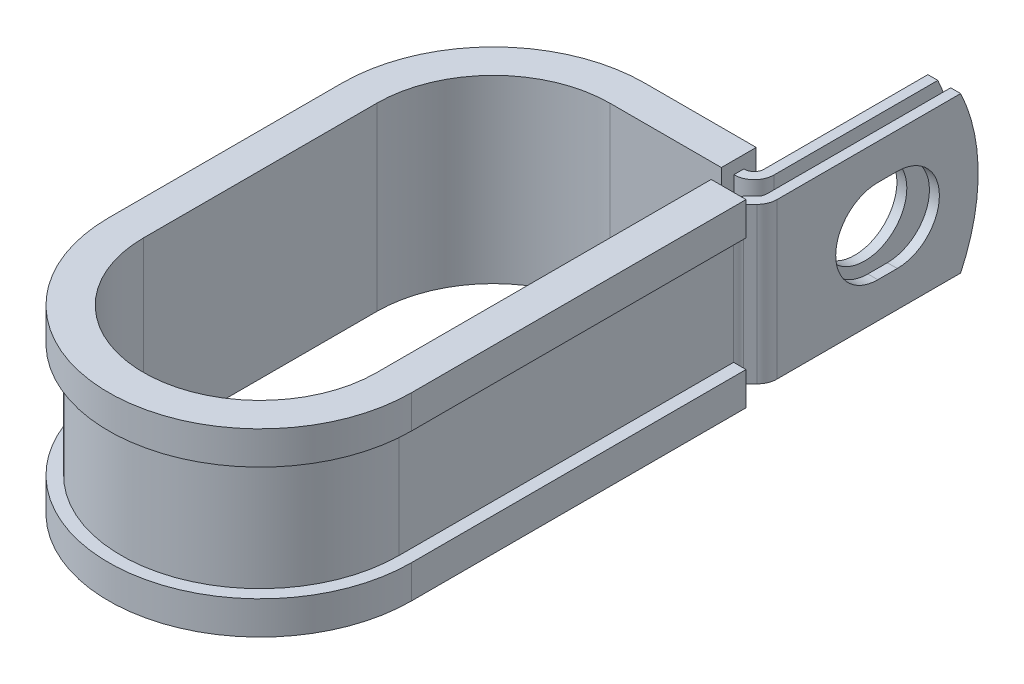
ISO-10303-21;
HEADER;
FILE_DESCRIPTION(('STEP AP214'),'2;1');
FILE_NAME('part.step','',(''),(''),'','','');
FILE_SCHEMA(('AUTOMOTIVE_DESIGN { 1 0 10303 214 1 1 1 1 }'));
ENDSEC;
DATA;
#1=APPLICATION_CONTEXT('core data for automotive mechanical design processes');
#2=APPLICATION_PROTOCOL_DEFINITION('international standard','automotive_design',2000,#1);
#3=PRODUCT_CONTEXT('',#1,'mechanical');
#4=PRODUCT('Part','Part','',(#3));
#5=PRODUCT_RELATED_PRODUCT_CATEGORY('part','',(#4));
#6=PRODUCT_DEFINITION_FORMATION('','',#4);
#7=PRODUCT_DEFINITION_CONTEXT('part definition',#1,'design');
#8=PRODUCT_DEFINITION('design','',#6,#7);
#9=PRODUCT_DEFINITION_SHAPE('','',#8);
#10=(LENGTH_UNIT() NAMED_UNIT(*) SI_UNIT(.MILLI.,.METRE.));
#11=(NAMED_UNIT(*) PLANE_ANGLE_UNIT() SI_UNIT($,.RADIAN.));
#12=(NAMED_UNIT(*) SI_UNIT($,.STERADIAN.) SOLID_ANGLE_UNIT());
#13=UNCERTAINTY_MEASURE_WITH_UNIT(LENGTH_MEASURE(1.E-05),#10,'distance_accuracy_value','');
#14=(GEOMETRIC_REPRESENTATION_CONTEXT(3) GLOBAL_UNCERTAINTY_ASSIGNED_CONTEXT((#13)) GLOBAL_UNIT_ASSIGNED_CONTEXT((#10,
#11,#12)) REPRESENTATION_CONTEXT('',''));
#15=CARTESIAN_POINT('',(0.,0.,0.));
#16=DIRECTION('',(0.,0.,1.));
#17=DIRECTION('',(1.,0.,0.));
#18=AXIS2_PLACEMENT_3D('',#15,#16,#17);
#19=CARTESIAN_POINT('',(16.4897698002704,-9.525,-15.8115));
#20=DIRECTION('',(0.,1.,0.));
#21=DIRECTION('',(1.,0.,0.));
#22=AXIS2_PLACEMENT_3D('',#19,#20,#21);
#23=PLANE('',#22);
#24=DIRECTION('',(0.,0.,-1.));
#25=VECTOR('',#24,1.);
#26=CARTESIAN_POINT('',(13.6449698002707,-9.525,-15.8115));
#27=LINE('',#26,#25);
#28=CARTESIAN_POINT('',(13.6449698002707,-9.525,-15.8115));
#29=VERTEX_POINT('',#28);
#30=CARTESIAN_POINT('',(13.6449698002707,-9.525,-17.0307));
#31=VERTEX_POINT('',#30);
#32=EDGE_CURVE('E582',#29,#31,#27,.T.);
#33=ORIENTED_EDGE('',*,*,#32,.T.);
#34=DIRECTION('',(1.,0.,0.));
#35=VECTOR('',#34,1.);
#36=CARTESIAN_POINT('',(0.,-9.525,-17.0307));
#37=LINE('',#36,#35);
#38=CARTESIAN_POINT('',(13.6957698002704,-9.525,-17.0307));
#39=VERTEX_POINT('',#38);
#40=EDGE_CURVE('E416',#39,#31,#37,.F.);
#41=ORIENTED_EDGE('',*,*,#40,.F.);
#42=CARTESIAN_POINT('',(13.6957698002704,-9.525,-18.2499));
#43=DIRECTION('',(0.,1.,0.));
#44=DIRECTION('',(1.,0.,0.));
#45=AXIS2_PLACEMENT_3D('',#42,#43,#44);
#46=CIRCLE('',#45,1.2192);
#47=CARTESIAN_POINT('',(14.9149698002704,-9.525,-18.2499));
#48=VERTEX_POINT('',#47);
#49=EDGE_CURVE('E414',#48,#39,#46,.F.);
#50=ORIENTED_EDGE('',*,*,#49,.F.);
#51=DIRECTION('',(0.,0.,1.));
#52=VECTOR('',#51,1.);
#53=CARTESIAN_POINT('',(14.9149698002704,-9.525,-40.4622));
#54=LINE('',#53,#52);
#55=CARTESIAN_POINT('',(14.9149698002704,-9.525,-38.3176631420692));
#56=VERTEX_POINT('',#55);
#57=EDGE_CURVE('E412',#56,#48,#54,.T.);
#58=ORIENTED_EDGE('',*,*,#57,.F.);
#59=DIRECTION('',(-1.,0.,0.));
#60=VECTOR('',#59,1.);
#61=CARTESIAN_POINT('',(18.9281698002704,-9.525,-38.3176631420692));
#62=LINE('',#61,#60);
#63=CARTESIAN_POINT('',(16.1341698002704,-9.525,-38.3176631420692));
#64=VERTEX_POINT('',#63);
#65=EDGE_CURVE('E12',#64,#56,#62,.T.);
#66=ORIENTED_EDGE('',*,*,#65,.F.);
#67=DIRECTION('',(0.,0.,1.));
#68=VECTOR('',#67,1.);
#69=CARTESIAN_POINT('',(16.1341698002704,-9.525,-40.4622));
#70=LINE('',#69,#68);
#71=CARTESIAN_POINT('',(16.1341698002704,-9.525,-18.2499));
#72=VERTEX_POINT('',#71);
#73=EDGE_CURVE('E410',#64,#72,#70,.T.);
#74=ORIENTED_EDGE('',*,*,#73,.T.);
#75=CARTESIAN_POINT('',(13.6957698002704,-9.525,-18.2499));
#76=DIRECTION('',(0.,-1.,0.));
#77=DIRECTION('',(0.,0.,1.));
#78=AXIS2_PLACEMENT_3D('',#75,#76,#77);
#79=CIRCLE('',#78,2.4384);
#80=CARTESIAN_POINT('',(13.6957698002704,-9.525,-15.8115));
#81=VERTEX_POINT('',#80);
#82=EDGE_CURVE('E407',#72,#81,#79,.T.);
#83=ORIENTED_EDGE('',*,*,#82,.T.);
#84=DIRECTION('',(-1.,0.,0.));
#85=VECTOR('',#84,1.);
#86=CARTESIAN_POINT('',(0.,-9.525,-15.8115));
#87=LINE('',#86,#85);
#88=EDGE_CURVE('E404',#81,#29,#87,.T.);
#89=ORIENTED_EDGE('',*,*,#88,.T.);
#90=EDGE_LOOP('',(#33,#41,#50,#58,#66,#74,#83,#89));
#91=FACE_BOUND('',#90,.T.);
#92=ADVANCED_FACE('F55',(#91),#23,.F.);
#93=CARTESIAN_POINT('',(16.4897698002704,9.525,-15.8115));
#94=DIRECTION('',(0.,1.,0.));
#95=DIRECTION('',(1.,0.,0.));
#96=AXIS2_PLACEMENT_3D('',#93,#94,#95);
#97=PLANE('',#96);
#98=DIRECTION('',(1.,0.,0.));
#99=VECTOR('',#98,1.);
#100=CARTESIAN_POINT('',(0.,9.525,-17.0307));
#101=LINE('',#100,#99);
#102=CARTESIAN_POINT('',(13.6957698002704,9.525,-17.0307));
#103=VERTEX_POINT('',#102);
#104=CARTESIAN_POINT('',(13.6449698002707,9.525,-17.0307));
#105=VERTEX_POINT('',#104);
#106=EDGE_CURVE('E377',#103,#105,#101,.F.);
#107=ORIENTED_EDGE('',*,*,#106,.T.);
#108=DIRECTION('',(0.,0.,1.));
#109=VECTOR('',#108,1.);
#110=CARTESIAN_POINT('',(13.6449698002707,9.525,-17.0307));
#111=LINE('',#110,#109);
#112=CARTESIAN_POINT('',(13.6449698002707,9.525,-15.8115));
#113=VERTEX_POINT('',#112);
#114=EDGE_CURVE('E588',#105,#113,#111,.T.);
#115=ORIENTED_EDGE('',*,*,#114,.T.);
#116=DIRECTION('',(-1.,0.,0.));
#117=VECTOR('',#116,1.);
#118=CARTESIAN_POINT('',(0.,9.525,-15.8115));
#119=LINE('',#118,#117);
#120=CARTESIAN_POINT('',(13.6957698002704,9.525,-15.8115));
#121=VERTEX_POINT('',#120);
#122=EDGE_CURVE('E479',#121,#113,#119,.T.);
#123=ORIENTED_EDGE('',*,*,#122,.F.);
#124=CARTESIAN_POINT('',(13.6957698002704,9.525,-18.2499));
#125=DIRECTION('',(0.,-1.,0.));
#126=DIRECTION('',(0.,0.,1.));
#127=AXIS2_PLACEMENT_3D('',#124,#125,#126);
#128=CIRCLE('',#127,2.4384);
#129=CARTESIAN_POINT('',(16.1341698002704,9.525,-18.2499));
#130=VERTEX_POINT('',#129);
#131=EDGE_CURVE('E474',#130,#121,#128,.T.);
#132=ORIENTED_EDGE('',*,*,#131,.F.);
#133=DIRECTION('',(0.,0.,1.));
#134=VECTOR('',#133,1.);
#135=CARTESIAN_POINT('',(16.1341698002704,9.525,-40.4622));
#136=LINE('',#135,#134);
#137=CARTESIAN_POINT('',(16.1341698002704,9.525,-38.3176631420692));
#138=VERTEX_POINT('',#137);
#139=EDGE_CURVE('E468',#138,#130,#136,.T.);
#140=ORIENTED_EDGE('',*,*,#139,.F.);
#141=DIRECTION('',(-1.,0.,0.));
#142=VECTOR('',#141,1.);
#143=CARTESIAN_POINT('',(18.9281698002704,9.525,-38.3176631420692));
#144=LINE('',#143,#142);
#145=CARTESIAN_POINT('',(14.9149698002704,9.525,-38.3176631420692));
#146=VERTEX_POINT('',#145);
#147=EDGE_CURVE('E63',#138,#146,#144,.T.);
#148=ORIENTED_EDGE('',*,*,#147,.T.);
#149=DIRECTION('',(0.,0.,1.));
#150=VECTOR('',#149,1.);
#151=CARTESIAN_POINT('',(14.9149698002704,9.525,-40.4622));
#152=LINE('',#151,#150);
#153=CARTESIAN_POINT('',(14.9149698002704,9.525,-18.2499));
#154=VERTEX_POINT('',#153);
#155=EDGE_CURVE('E465',#146,#154,#152,.T.);
#156=ORIENTED_EDGE('',*,*,#155,.T.);
#157=CARTESIAN_POINT('',(13.6957698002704,9.525,-18.2499));
#158=DIRECTION('',(0.,1.,0.));
#159=DIRECTION('',(1.,0.,0.));
#160=AXIS2_PLACEMENT_3D('',#157,#158,#159);
#161=CIRCLE('',#160,1.2192);
#162=EDGE_CURVE('E382',#154,#103,#161,.F.);
#163=ORIENTED_EDGE('',*,*,#162,.T.);
#164=EDGE_LOOP('',(#107,#115,#123,#132,#140,#148,#156,#163));
#165=FACE_BOUND('',#164,.T.);
#166=ADVANCED_FACE('F464',(#165),#97,.T.);
#167=CARTESIAN_POINT('',(0.,9.525,-15.8115));
#168=DIRECTION('',(0.,0.,1.));
#169=DIRECTION('',(1.,0.,0.));
#170=AXIS2_PLACEMENT_3D('',#167,#168,#169);
#171=PLANE('',#170);
#172=ORIENTED_EDGE('',*,*,#122,.T.);
#173=DIRECTION('',(0.,-1.,0.));
#174=VECTOR('',#173,1.);
#175=CARTESIAN_POINT('',(13.6449698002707,9.525,-15.8115));
#176=LINE('',#175,#174);
#177=EDGE_CURVE('E585',#113,#29,#176,.T.);
#178=ORIENTED_EDGE('',*,*,#177,.T.);
#179=ORIENTED_EDGE('',*,*,#88,.F.);
#180=DIRECTION('',(0.,-1.,0.));
#181=VECTOR('',#180,1.);
#182=CARTESIAN_POINT('',(13.6957698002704,9.525,-15.8115));
#183=LINE('',#182,#181);
#184=EDGE_CURVE('E452',#121,#81,#183,.T.);
#185=ORIENTED_EDGE('',*,*,#184,.F.);
#186=EDGE_LOOP('',(#172,#178,#179,#185));
#187=FACE_BOUND('',#186,.T.);
#188=ADVANCED_FACE('F789',(#187),#171,.T.);
#189=CARTESIAN_POINT('',(18.9281698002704,9.525,-15.8115));
#190=DIRECTION('',(-1.,0.,0.));
#191=DIRECTION('',(0.,0.,1.));
#192=AXIS2_PLACEMENT_3D('',#189,#190,#191);
#193=PLANE('',#192);
#194=CARTESIAN_POINT('',(18.9281698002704,0.,-30.5561999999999));
#195=DIRECTION('',(1.,0.,0.));
#196=DIRECTION('',(0.,0.,-1.));
#197=AXIS2_PLACEMENT_3D('',#194,#195,#196);
#198=CIRCLE('',#197,5.1562);
#199=CARTESIAN_POINT('',(18.9281698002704,-5.1562,-30.5562000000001));
#200=VERTEX_POINT('',#199);
#201=CARTESIAN_POINT('',(18.9281698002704,5.1562,-30.5562000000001));
#202=VERTEX_POINT('',#201);
#203=EDGE_CURVE('E527',#200,#202,#198,.T.);
#204=ORIENTED_EDGE('',*,*,#203,.F.);
#205=DIRECTION('',(0.,0.,-1.));
#206=VECTOR('',#205,1.);
#207=CARTESIAN_POINT('',(18.9281698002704,-5.1562,-28.1685999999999));
#208=LINE('',#207,#206);
#209=CARTESIAN_POINT('',(18.9281698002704,-5.1562,-28.1685999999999));
#210=VERTEX_POINT('',#209);
#211=EDGE_CURVE('E524',#210,#200,#208,.T.);
#212=ORIENTED_EDGE('',*,*,#211,.F.);
#213=CARTESIAN_POINT('',(18.9281698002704,0.,-28.1685999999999));
#214=DIRECTION('',(1.,0.,0.));
#215=DIRECTION('',(0.,0.,-1.));
#216=AXIS2_PLACEMENT_3D('',#213,#214,#215);
#217=CIRCLE('',#216,5.1562);
#218=CARTESIAN_POINT('',(18.9281698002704,5.1562,-28.1685999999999));
#219=VERTEX_POINT('',#218);
#220=EDGE_CURVE('E521',#219,#210,#217,.T.);
#221=ORIENTED_EDGE('',*,*,#220,.F.);
#222=DIRECTION('',(0.,0.,1.));
#223=VECTOR('',#222,1.);
#224=CARTESIAN_POINT('',(18.9281698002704,5.1562,-28.1685999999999));
#225=LINE('',#224,#223);
#226=EDGE_CURVE('E520',#202,#219,#225,.T.);
#227=ORIENTED_EDGE('',*,*,#226,.F.);
#228=EDGE_LOOP('',(#204,#212,#221,#227));
#229=FACE_BOUND('',#228,.T.);
#230=DIRECTION('',(0.,0.,-1.));
#231=VECTOR('',#230,1.);
#232=CARTESIAN_POINT('',(18.9281698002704,-9.525,-15.8115));
#233=LINE('',#232,#231);
#234=CARTESIAN_POINT('',(18.9281698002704,-9.525,-15.8115));
#235=VERTEX_POINT('',#234);
#236=CARTESIAN_POINT('',(18.9281698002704,-9.525,-38.3176631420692));
#237=VERTEX_POINT('',#236);
#238=EDGE_CURVE('E388',#235,#237,#233,.T.);
#239=ORIENTED_EDGE('',*,*,#238,.T.);
#240=CARTESIAN_POINT('',(18.9281698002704,0.,-18.2372));
#241=DIRECTION('',(-1.,0.,0.));
#242=DIRECTION('',(0.,0.,1.));
#243=AXIS2_PLACEMENT_3D('',#240,#241,#242);
#244=CIRCLE('',#243,22.225);
#245=CARTESIAN_POINT('',(18.9281698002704,9.525,-38.3176631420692));
#246=VERTEX_POINT('',#245);
#247=EDGE_CURVE('E536',#246,#237,#244,.T.);
#248=ORIENTED_EDGE('',*,*,#247,.F.);
#249=DIRECTION('',(0.,0.,-1.));
#250=VECTOR('',#249,1.);
#251=CARTESIAN_POINT('',(18.9281698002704,9.525,-15.8115));
#252=LINE('',#251,#250);
#253=CARTESIAN_POINT('',(18.9281698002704,9.525,-15.8115));
#254=VERTEX_POINT('',#253);
#255=EDGE_CURVE('E425',#254,#246,#252,.T.);
#256=ORIENTED_EDGE('',*,*,#255,.F.);
#257=DIRECTION('',(0.,-1.,0.));
#258=VECTOR('',#257,1.);
#259=CARTESIAN_POINT('',(18.9281698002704,9.525,-15.8115));
#260=LINE('',#259,#258);
#261=EDGE_CURVE('E387',#254,#235,#260,.T.);
#262=ORIENTED_EDGE('',*,*,#261,.T.);
#263=EDGE_LOOP('',(#239,#248,#256,#262));
#264=FACE_BOUND('',#263,.T.);
#265=ADVANCED_FACE('F57',(#229,#264),#193,.F.);
#266=CARTESIAN_POINT('',(17.7089698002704,9.525,-15.8115));
#267=DIRECTION('',(-1.,0.,0.));
#268=DIRECTION('',(0.,0.,1.));
#269=AXIS2_PLACEMENT_3D('',#266,#267,#268);
#270=PLANE('',#269);
#271=DIRECTION('',(0.,0.,-1.));
#272=VECTOR('',#271,1.);
#273=CARTESIAN_POINT('',(17.7089698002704,-5.1562,-28.1685999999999));
#274=LINE('',#273,#272);
#275=CARTESIAN_POINT('',(17.7089698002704,-5.1562,-28.1685999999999));
#276=VERTEX_POINT('',#275);
#277=CARTESIAN_POINT('',(17.7089698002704,-5.1562,-30.5562000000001));
#278=VERTEX_POINT('',#277);
#279=EDGE_CURVE('E505',#276,#278,#274,.T.);
#280=ORIENTED_EDGE('',*,*,#279,.T.);
#281=CARTESIAN_POINT('',(17.7089698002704,0.,-30.5561999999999));
#282=DIRECTION('',(-1.,0.,0.));
#283=DIRECTION('',(0.,0.,1.));
#284=AXIS2_PLACEMENT_3D('',#281,#282,#283);
#285=CIRCLE('',#284,5.1562);
#286=CARTESIAN_POINT('',(17.7089698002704,5.1562,-30.5562000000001));
#287=VERTEX_POINT('',#286);
#288=EDGE_CURVE('E504',#278,#287,#285,.F.);
#289=ORIENTED_EDGE('',*,*,#288,.T.);
#290=DIRECTION('',(0.,0.,1.));
#291=VECTOR('',#290,1.);
#292=CARTESIAN_POINT('',(17.7089698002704,5.1562,-28.1685999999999));
#293=LINE('',#292,#291);
#294=CARTESIAN_POINT('',(17.7089698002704,5.1562,-28.1685999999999));
#295=VERTEX_POINT('',#294);
#296=EDGE_CURVE('E508',#287,#295,#293,.T.);
#297=ORIENTED_EDGE('',*,*,#296,.T.);
#298=CARTESIAN_POINT('',(17.7089698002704,0.,-28.1685999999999));
#299=DIRECTION('',(-1.,0.,0.));
#300=DIRECTION('',(0.,0.,1.));
#301=AXIS2_PLACEMENT_3D('',#298,#299,#300);
#302=CIRCLE('',#301,5.1562);
#303=EDGE_CURVE('E501',#295,#276,#302,.F.);
#304=ORIENTED_EDGE('',*,*,#303,.T.);
#305=EDGE_LOOP('',(#280,#289,#297,#304));
#306=FACE_BOUND('',#305,.T.);
#307=CARTESIAN_POINT('',(17.7089698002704,0.,-18.2372));
#308=DIRECTION('',(-1.,0.,0.));
#309=DIRECTION('',(0.,0.,1.));
#310=AXIS2_PLACEMENT_3D('',#307,#308,#309);
#311=CIRCLE('',#310,22.225);
#312=CARTESIAN_POINT('',(17.7089698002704,9.525,-38.3176631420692));
#313=VERTEX_POINT('',#312);
#314=CARTESIAN_POINT('',(17.7089698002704,-9.525,-38.3176631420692));
#315=VERTEX_POINT('',#314);
#316=EDGE_CURVE('E77',#313,#315,#311,.T.);
#317=ORIENTED_EDGE('',*,*,#316,.T.);
#318=DIRECTION('',(0.,0.,-1.));
#319=VECTOR('',#318,1.);
#320=CARTESIAN_POINT('',(17.7089698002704,-9.525,-15.8115));
#321=LINE('',#320,#319);
#322=CARTESIAN_POINT('',(17.7089698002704,-9.525,-15.8115));
#323=VERTEX_POINT('',#322);
#324=EDGE_CURVE('E391',#323,#315,#321,.T.);
#325=ORIENTED_EDGE('',*,*,#324,.F.);
#326=DIRECTION('',(0.,-1.,0.));
#327=VECTOR('',#326,1.);
#328=CARTESIAN_POINT('',(17.7089698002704,9.525,-15.8115));
#329=LINE('',#328,#327);
#330=CARTESIAN_POINT('',(17.7089698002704,9.525,-15.8115));
#331=VERTEX_POINT('',#330);
#332=EDGE_CURVE('E460',#331,#323,#329,.T.);
#333=ORIENTED_EDGE('',*,*,#332,.F.);
#334=DIRECTION('',(0.,0.,-1.));
#335=VECTOR('',#334,1.);
#336=CARTESIAN_POINT('',(17.7089698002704,9.525,-15.8115));
#337=LINE('',#336,#335);
#338=EDGE_CURVE('E489',#331,#313,#337,.T.);
#339=ORIENTED_EDGE('',*,*,#338,.T.);
#340=EDGE_LOOP('',(#317,#325,#333,#339));
#341=FACE_BOUND('',#340,.T.);
#342=ADVANCED_FACE('F762',(#306,#341),#270,.T.);
#343=CARTESIAN_POINT('',(16.1341698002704,9.525,-40.4622));
#344=DIRECTION('',(1.,0.,0.));
#345=DIRECTION('',(0.,0.,-1.));
#346=AXIS2_PLACEMENT_3D('',#343,#344,#345);
#347=PLANE('',#346);
#348=CARTESIAN_POINT('',(16.1341698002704,0.,-29.3624));
#349=DIRECTION('',(1.,0.,0.));
#350=DIRECTION('',(0.,0.,-1.));
#351=AXIS2_PLACEMENT_3D('',#348,#349,#350);
#352=CIRCLE('',#351,5.1562);
#353=CARTESIAN_POINT('',(16.1341698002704,0.,-34.5186));
#354=VERTEX_POINT('',#353);
#355=EDGE_CURVE('E392',#354,#354,#352,.F.);
#356=ORIENTED_EDGE('',*,*,#355,.T.);
#357=EDGE_LOOP('',(#356));
#358=FACE_BOUND('',#357,.T.);
#359=ORIENTED_EDGE('',*,*,#73,.F.);
#360=CARTESIAN_POINT('',(16.1341698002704,0.,-18.2372));
#361=DIRECTION('',(1.,0.,0.));
#362=DIRECTION('',(0.,0.,-1.));
#363=AXIS2_PLACEMENT_3D('',#360,#361,#362);
#364=CIRCLE('',#363,22.225);
#365=EDGE_CURVE('E532',#64,#138,#364,.T.);
#366=ORIENTED_EDGE('',*,*,#365,.T.);
#367=ORIENTED_EDGE('',*,*,#139,.T.);
#368=DIRECTION('',(0.,-1.,0.));
#369=VECTOR('',#368,1.);
#370=CARTESIAN_POINT('',(16.1341698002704,9.525,-18.2499));
#371=LINE('',#370,#369);
#372=EDGE_CURVE('E449',#130,#72,#371,.T.);
#373=ORIENTED_EDGE('',*,*,#372,.T.);
#374=EDGE_LOOP('',(#359,#366,#367,#373));
#375=FACE_BOUND('',#374,.T.);
#376=ADVANCED_FACE('F797',(#358,#375),#347,.T.);
#377=CARTESIAN_POINT('',(14.9149698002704,9.525,-40.4622));
#378=DIRECTION('',(1.,0.,0.));
#379=DIRECTION('',(0.,0.,-1.));
#380=AXIS2_PLACEMENT_3D('',#377,#378,#379);
#381=PLANE('',#380);
#382=CARTESIAN_POINT('',(14.9149698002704,0.,-29.3624));
#383=DIRECTION('',(-1.,0.,0.));
#384=DIRECTION('',(0.,0.,1.));
#385=AXIS2_PLACEMENT_3D('',#382,#383,#384);
#386=CIRCLE('',#385,5.1562);
#387=CARTESIAN_POINT('',(14.9149698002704,0.,-24.2062));
#388=VERTEX_POINT('',#387);
#389=EDGE_CURVE('E496',#388,#388,#386,.T.);
#390=ORIENTED_EDGE('',*,*,#389,.F.);
#391=EDGE_LOOP('',(#390));
#392=FACE_BOUND('',#391,.T.);
#393=CARTESIAN_POINT('',(14.9149698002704,0.,-18.2372));
#394=DIRECTION('',(-1.,0.,0.));
#395=DIRECTION('',(0.,0.,1.));
#396=AXIS2_PLACEMENT_3D('',#393,#394,#395);
#397=CIRCLE('',#396,22.225);
#398=EDGE_CURVE('E69',#146,#56,#397,.T.);
#399=ORIENTED_EDGE('',*,*,#398,.T.);
#400=ORIENTED_EDGE('',*,*,#57,.T.);
#401=DIRECTION('',(0.,-1.,0.));
#402=VECTOR('',#401,1.);
#403=CARTESIAN_POINT('',(14.9149698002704,9.525,-18.2499));
#404=LINE('',#403,#402);
#405=EDGE_CURVE('E446',#154,#48,#404,.T.);
#406=ORIENTED_EDGE('',*,*,#405,.F.);
#407=ORIENTED_EDGE('',*,*,#155,.F.);
#408=EDGE_LOOP('',(#399,#400,#406,#407));
#409=FACE_BOUND('',#408,.T.);
#410=ADVANCED_FACE('F471',(#392,#409),#381,.F.);
#411=CARTESIAN_POINT('',(18.2499,-9.525,-12.3990026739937));
#412=DIRECTION('',(0.,1.,0.));
#413=DIRECTION('',(1.,0.,0.));
#414=AXIS2_PLACEMENT_3D('',#411,#412,#413);
#415=CIRCLE('',#414,1.2192);
#416=CARTESIAN_POINT('',(17.0307,-9.525,-12.3990026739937));
#417=VERTEX_POINT('',#416);
#418=CARTESIAN_POINT('',(17.3877954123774,-9.525,-13.2611072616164));
#419=VERTEX_POINT('',#418);
#420=EDGE_CURVE('E419',#417,#419,#415,.F.);
#421=ORIENTED_EDGE('',*,*,#420,.F.);
#422=DIRECTION('',(1.,0.,0.));
#423=VECTOR('',#422,1.);
#424=CARTESIAN_POINT('',(15.8115,-9.525,-12.3990026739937));
#425=LINE('',#424,#423);
#426=CARTESIAN_POINT('',(15.8115,-9.525,-12.3990026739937));
#427=VERTEX_POINT('',#426);
#428=EDGE_CURVE('E370',#427,#417,#425,.T.);
#429=ORIENTED_EDGE('',*,*,#428,.F.);
#430=CARTESIAN_POINT('',(18.2499,-9.525,-12.3990026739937));
#431=DIRECTION('',(0.,-1.,0.));
#432=DIRECTION('',(0.,0.,1.));
#433=AXIS2_PLACEMENT_3D('',#430,#431,#432);
#434=CIRCLE('',#433,2.4384);
#435=CARTESIAN_POINT('',(16.5256908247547,-9.525,-14.123211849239));
#436=VERTEX_POINT('',#435);
#437=EDGE_CURVE('E401',#427,#436,#434,.T.);
#438=ORIENTED_EDGE('',*,*,#437,.T.);
#439=DIRECTION('',(0.707106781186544,0.,-0.707106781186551));
#440=VECTOR('',#439,1.);
#441=CARTESIAN_POINT('',(16.5256908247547,-9.525,-14.123211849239));
#442=LINE('',#441,#440);
#443=CARTESIAN_POINT('',(17.3518743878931,-9.525,-14.9493954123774));
#444=VERTEX_POINT('',#443);
#445=EDGE_CURVE('E398',#436,#444,#442,.T.);
#446=ORIENTED_EDGE('',*,*,#445,.T.);
#447=CARTESIAN_POINT('',(16.4897698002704,-9.525,-15.8115));
#448=DIRECTION('',(0.,1.,0.));
#449=DIRECTION('',(0.,0.,1.));
#450=AXIS2_PLACEMENT_3D('',#447,#448,#449);
#451=CIRCLE('',#450,1.2192);
#452=EDGE_CURVE('E395',#444,#323,#451,.T.);
#453=ORIENTED_EDGE('',*,*,#452,.T.);
#454=ORIENTED_EDGE('',*,*,#324,.T.);
#455=DIRECTION('',(-1.,0.,0.));
#456=VECTOR('',#455,1.);
#457=CARTESIAN_POINT('',(18.9281698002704,-9.525,-38.3176631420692));
#458=LINE('',#457,#456);
#459=EDGE_CURVE('E538',#237,#315,#458,.T.);
#460=ORIENTED_EDGE('',*,*,#459,.F.);
#461=ORIENTED_EDGE('',*,*,#238,.F.);
#462=CARTESIAN_POINT('',(16.4897698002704,-9.525,-15.8115));
#463=DIRECTION('',(0.,1.,0.));
#464=DIRECTION('',(1.,0.,0.));
#465=AXIS2_PLACEMENT_3D('',#462,#463,#464);
#466=CIRCLE('',#465,2.4384);
#467=CARTESIAN_POINT('',(18.2139789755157,-9.525,-14.0872908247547));
#468=VERTEX_POINT('',#467);
#469=EDGE_CURVE('E423',#468,#235,#466,.T.);
#470=ORIENTED_EDGE('',*,*,#469,.F.);
#471=DIRECTION('',(0.707106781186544,0.,-0.707106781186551));
#472=VECTOR('',#471,1.);
#473=CARTESIAN_POINT('',(17.3877954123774,-9.525,-13.2611072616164));
#474=LINE('',#473,#472);
#475=EDGE_CURVE('E421',#419,#468,#474,.T.);
#476=ORIENTED_EDGE('',*,*,#475,.F.);
#477=EDGE_LOOP('',(#421,#429,#438,#446,#453,#454,#460,#461,#470,#476));
#478=FACE_BOUND('',#477,.T.);
#479=ADVANCED_FACE('F743',(#478),#23,.F.);
#480=DIRECTION('',(-1.,0.,0.));
#481=VECTOR('',#480,1.);
#482=CARTESIAN_POINT('',(17.0307,9.525,-12.3990026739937));
#483=LINE('',#482,#481);
#484=CARTESIAN_POINT('',(17.0307,9.525,-12.3990026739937));
#485=VERTEX_POINT('',#484);
#486=CARTESIAN_POINT('',(15.8115,9.525,-12.3990026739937));
#487=VERTEX_POINT('',#486);
#488=EDGE_CURVE('E350',#485,#487,#483,.T.);
#489=ORIENTED_EDGE('',*,*,#488,.F.);
#490=CARTESIAN_POINT('',(18.2499,9.525,-12.3990026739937));
#491=DIRECTION('',(0.,1.,0.));
#492=DIRECTION('',(1.,0.,0.));
#493=AXIS2_PLACEMENT_3D('',#490,#491,#492);
#494=CIRCLE('',#493,1.2192);
#495=CARTESIAN_POINT('',(17.3877954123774,9.525,-13.2611072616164));
#496=VERTEX_POINT('',#495);
#497=EDGE_CURVE('E365',#485,#496,#494,.F.);
#498=ORIENTED_EDGE('',*,*,#497,.T.);
#499=DIRECTION('',(0.707106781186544,0.,-0.707106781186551));
#500=VECTOR('',#499,1.);
#501=CARTESIAN_POINT('',(17.3877954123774,9.525,-13.2611072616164));
#502=LINE('',#501,#500);
#503=CARTESIAN_POINT('',(18.2139789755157,9.525,-14.0872908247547));
#504=VERTEX_POINT('',#503);
#505=EDGE_CURVE('E376',#496,#504,#502,.T.);
#506=ORIENTED_EDGE('',*,*,#505,.T.);
#507=CARTESIAN_POINT('',(16.4897698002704,9.525,-15.8115));
#508=DIRECTION('',(0.,1.,0.));
#509=DIRECTION('',(1.,0.,0.));
#510=AXIS2_PLACEMENT_3D('',#507,#508,#509);
#511=CIRCLE('',#510,2.4384);
#512=EDGE_CURVE('E379',#504,#254,#511,.T.);
#513=ORIENTED_EDGE('',*,*,#512,.T.);
#514=ORIENTED_EDGE('',*,*,#255,.T.);
#515=DIRECTION('',(-1.,0.,0.));
#516=VECTOR('',#515,1.);
#517=CARTESIAN_POINT('',(18.9281698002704,9.525,-38.3176631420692));
#518=LINE('',#517,#516);
#519=EDGE_CURVE('E534',#246,#313,#518,.T.);
#520=ORIENTED_EDGE('',*,*,#519,.T.);
#521=ORIENTED_EDGE('',*,*,#338,.F.);
#522=CARTESIAN_POINT('',(16.4897698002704,9.525,-15.8115));
#523=DIRECTION('',(0.,1.,0.));
#524=DIRECTION('',(0.,0.,1.));
#525=AXIS2_PLACEMENT_3D('',#522,#523,#524);
#526=CIRCLE('',#525,1.2192);
#527=CARTESIAN_POINT('',(17.3518743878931,9.525,-14.9493954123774));
#528=VERTEX_POINT('',#527);
#529=EDGE_CURVE('E486',#528,#331,#526,.T.);
#530=ORIENTED_EDGE('',*,*,#529,.F.);
#531=DIRECTION('',(0.707106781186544,0.,-0.707106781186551));
#532=VECTOR('',#531,1.);
#533=CARTESIAN_POINT('',(16.5256908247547,9.525,-14.123211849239));
#534=LINE('',#533,#532);
#535=CARTESIAN_POINT('',(16.5256908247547,9.525,-14.123211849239));
#536=VERTEX_POINT('',#535);
#537=EDGE_CURVE('E483',#536,#528,#534,.T.);
#538=ORIENTED_EDGE('',*,*,#537,.F.);
#539=CARTESIAN_POINT('',(18.2499,9.525,-12.3990026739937));
#540=DIRECTION('',(0.,-1.,0.));
#541=DIRECTION('',(0.,0.,1.));
#542=AXIS2_PLACEMENT_3D('',#539,#540,#541);
#543=CIRCLE('',#542,2.4384);
#544=EDGE_CURVE('E369',#487,#536,#543,.T.);
#545=ORIENTED_EDGE('',*,*,#544,.F.);
#546=EDGE_LOOP('',(#489,#498,#506,#513,#514,#520,#521,#530,#538,#545));
#547=FACE_BOUND('',#546,.T.);
#548=ADVANCED_FACE('F364',(#547),#97,.T.);
#549=CARTESIAN_POINT('',(16.4897698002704,9.525,-15.8115));
#550=DIRECTION('',(0.,-1.,0.));
#551=DIRECTION('',(0.,0.,-1.));
#552=AXIS2_PLACEMENT_3D('',#549,#550,#551);
#553=CYLINDRICAL_SURFACE('',#552,1.2192);
#554=ORIENTED_EDGE('',*,*,#452,.F.);
#555=DIRECTION('',(0.,-1.,0.));
#556=VECTOR('',#555,1.);
#557=CARTESIAN_POINT('',(17.3518743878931,9.525,-14.9493954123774));
#558=LINE('',#557,#556);
#559=EDGE_CURVE('E458',#528,#444,#558,.T.);
#560=ORIENTED_EDGE('',*,*,#559,.F.);
#561=ORIENTED_EDGE('',*,*,#529,.T.);
#562=ORIENTED_EDGE('',*,*,#332,.T.);
#563=EDGE_LOOP('',(#554,#560,#561,#562));
#564=FACE_BOUND('',#563,.T.);
#565=ADVANCED_FACE('F765',(#564),#553,.F.);
#566=CARTESIAN_POINT('',(16.5256908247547,9.525,-14.123211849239));
#567=DIRECTION('',(-0.707106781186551,0.,-0.707106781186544));
#568=DIRECTION('',(-0.707106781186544,0.,0.707106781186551));
#569=AXIS2_PLACEMENT_3D('',#566,#567,#568);
#570=PLANE('',#569);
#571=ORIENTED_EDGE('',*,*,#445,.F.);
#572=DIRECTION('',(0.,-1.,0.));
#573=VECTOR('',#572,1.);
#574=CARTESIAN_POINT('',(16.5256908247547,9.525,-14.123211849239));
#575=LINE('',#574,#573);
#576=EDGE_CURVE('E456',#536,#436,#575,.T.);
#577=ORIENTED_EDGE('',*,*,#576,.F.);
#578=ORIENTED_EDGE('',*,*,#537,.T.);
#579=ORIENTED_EDGE('',*,*,#559,.T.);
#580=EDGE_LOOP('',(#571,#577,#578,#579));
#581=FACE_BOUND('',#580,.T.);
#582=ADVANCED_FACE('F768',(#581),#570,.T.);
#583=CARTESIAN_POINT('',(18.2499,9.525,-12.3990026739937));
#584=DIRECTION('',(0.,-1.,0.));
#585=DIRECTION('',(0.,0.,-1.));
#586=AXIS2_PLACEMENT_3D('',#583,#584,#585);
#587=CYLINDRICAL_SURFACE('',#586,2.4384);
#588=ORIENTED_EDGE('',*,*,#437,.F.);
#589=DIRECTION('',(0.,-1.,0.));
#590=VECTOR('',#589,1.);
#591=CARTESIAN_POINT('',(15.8115,9.525,-12.3990026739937));
#592=LINE('',#591,#590);
#593=EDGE_CURVE('E454',#487,#427,#592,.T.);
#594=ORIENTED_EDGE('',*,*,#593,.F.);
#595=ORIENTED_EDGE('',*,*,#544,.T.);
#596=ORIENTED_EDGE('',*,*,#576,.T.);
#597=EDGE_LOOP('',(#588,#594,#595,#596));
#598=FACE_BOUND('',#597,.T.);
#599=ADVANCED_FACE('F770',(#598),#587,.T.);
#600=CARTESIAN_POINT('',(13.6957698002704,9.525,-18.2499));
#601=DIRECTION('',(0.,-1.,0.));
#602=DIRECTION('',(0.,0.,-1.));
#603=AXIS2_PLACEMENT_3D('',#600,#601,#602);
#604=CYLINDRICAL_SURFACE('',#603,2.4384);
#605=ORIENTED_EDGE('',*,*,#82,.F.);
#606=ORIENTED_EDGE('',*,*,#372,.F.);
#607=ORIENTED_EDGE('',*,*,#131,.T.);
#608=ORIENTED_EDGE('',*,*,#184,.T.);
#609=EDGE_LOOP('',(#605,#606,#607,#608));
#610=FACE_BOUND('',#609,.T.);
#611=ADVANCED_FACE('F772',(#610),#604,.T.);
#612=CARTESIAN_POINT('',(13.6957698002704,9.525,-18.2499));
#613=DIRECTION('',(0.,-1.,0.));
#614=DIRECTION('',(0.,0.,-1.));
#615=AXIS2_PLACEMENT_3D('',#612,#613,#614);
#616=CYLINDRICAL_SURFACE('',#615,1.2192);
#617=ORIENTED_EDGE('',*,*,#49,.T.);
#618=DIRECTION('',(0.,-1.,0.));
#619=VECTOR('',#618,1.);
#620=CARTESIAN_POINT('',(13.6957698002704,9.525,-17.0307));
#621=LINE('',#620,#619);
#622=EDGE_CURVE('E443',#103,#39,#621,.T.);
#623=ORIENTED_EDGE('',*,*,#622,.F.);
#624=ORIENTED_EDGE('',*,*,#162,.F.);
#625=ORIENTED_EDGE('',*,*,#405,.T.);
#626=EDGE_LOOP('',(#617,#623,#624,#625));
#627=FACE_BOUND('',#626,.T.);
#628=ADVANCED_FACE('F778',(#627),#616,.F.);
#629=CARTESIAN_POINT('',(0.,9.525,-17.0307));
#630=DIRECTION('',(0.,0.,1.));
#631=DIRECTION('',(1.,0.,0.));
#632=AXIS2_PLACEMENT_3D('',#629,#630,#631);
#633=PLANE('',#632);
#634=DIRECTION('',(0.,-1.,0.));
#635=VECTOR('',#634,1.);
#636=CARTESIAN_POINT('',(0.,9.525,-17.0307));
#637=LINE('',#636,#635);
#638=CARTESIAN_POINT('',(2.38661138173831E-13,6.985,-17.0307));
#639=VERTEX_POINT('',#638);
#640=CARTESIAN_POINT('',(2.38661138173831E-13,-6.985,-17.0307));
#641=VERTEX_POINT('',#640);
#642=EDGE_CURVE('E440',#639,#641,#637,.T.);
#643=ORIENTED_EDGE('',*,*,#642,.F.);
#644=DIRECTION('',(1.,0.,0.));
#645=VECTOR('',#644,1.);
#646=CARTESIAN_POINT('',(2.38661138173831E-13,6.985,-17.0307));
#647=LINE('',#646,#645);
#648=CARTESIAN_POINT('',(13.6449698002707,6.985,-17.0307));
#649=VERTEX_POINT('',#648);
#650=EDGE_CURVE('E541',#639,#649,#647,.T.);
#651=ORIENTED_EDGE('',*,*,#650,.T.);
#652=DIRECTION('',(0.,1.,0.));
#653=VECTOR('',#652,1.);
#654=CARTESIAN_POINT('',(13.6449698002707,9.525,-17.0307));
#655=LINE('',#654,#653);
#656=EDGE_CURVE('E591',#649,#105,#655,.T.);
#657=ORIENTED_EDGE('',*,*,#656,.T.);
#658=ORIENTED_EDGE('',*,*,#106,.F.);
#659=ORIENTED_EDGE('',*,*,#622,.T.);
#660=ORIENTED_EDGE('',*,*,#40,.T.);
#661=DIRECTION('',(0.,1.,0.));
#662=VECTOR('',#661,1.);
#663=CARTESIAN_POINT('',(13.6449698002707,-9.525,-17.0307));
#664=LINE('',#663,#662);
#665=CARTESIAN_POINT('',(13.6449698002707,-6.985,-17.0307));
#666=VERTEX_POINT('',#665);
#667=EDGE_CURVE('E579',#31,#666,#664,.T.);
#668=ORIENTED_EDGE('',*,*,#667,.T.);
#669=DIRECTION('',(1.,0.,0.));
#670=VECTOR('',#669,1.);
#671=CARTESIAN_POINT('',(2.38661138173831E-13,-6.985,-17.0307));
#672=LINE('',#671,#670);
#673=EDGE_CURVE('E562',#641,#666,#672,.T.);
#674=ORIENTED_EDGE('',*,*,#673,.F.);
#675=EDGE_LOOP('',(#643,#651,#657,#658,#659,#660,#668,#674));
#676=FACE_BOUND('',#675,.T.);
#677=ADVANCED_FACE('F830',(#676),#633,.F.);
#678=CARTESIAN_POINT('',(0.,9.525,0.));
#679=DIRECTION('',(0.,-1.,0.));
#680=DIRECTION('',(0.,0.,-1.));
#681=AXIS2_PLACEMENT_3D('',#678,#679,#680);
#682=CYLINDRICAL_SURFACE('',#681,17.0307);
#683=DIRECTION('',(0.,-1.,0.));
#684=VECTOR('',#683,1.);
#685=CARTESIAN_POINT('',(-17.0307,9.525,0.));
#686=LINE('',#685,#684);
#687=CARTESIAN_POINT('',(-17.0307,6.985,-2.35922392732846E-13));
#688=VERTEX_POINT('',#687);
#689=CARTESIAN_POINT('',(-17.0307,-6.985,-2.35922392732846E-13));
#690=VERTEX_POINT('',#689);
#691=EDGE_CURVE('E437',#688,#690,#686,.T.);
#692=ORIENTED_EDGE('',*,*,#691,.F.);
#693=CARTESIAN_POINT('',(0.,6.985,0.));
#694=DIRECTION('',(0.,-1.,0.));
#695=DIRECTION('',(0.,0.,-1.));
#696=AXIS2_PLACEMENT_3D('',#693,#694,#695);
#697=CIRCLE('',#696,17.0307);
#698=EDGE_CURVE('E594',#688,#639,#697,.T.);
#699=ORIENTED_EDGE('',*,*,#698,.T.);
#700=ORIENTED_EDGE('',*,*,#642,.T.);
#701=CARTESIAN_POINT('',(0.,-6.985,0.));
#702=DIRECTION('',(0.,-1.,0.));
#703=DIRECTION('',(0.,0.,-1.));
#704=AXIS2_PLACEMENT_3D('',#701,#702,#703);
#705=CIRCLE('',#704,17.0307);
#706=EDGE_CURVE('E615',#690,#641,#705,.T.);
#707=ORIENTED_EDGE('',*,*,#706,.F.);
#708=EDGE_LOOP('',(#692,#699,#700,#707));
#709=FACE_BOUND('',#708,.T.);
#710=ADVANCED_FACE('F841',(#709),#682,.T.);
#711=CARTESIAN_POINT('',(-17.0307,9.525,0.));
#712=DIRECTION('',(1.,0.,0.));
#713=DIRECTION('',(0.,0.,-1.));
#714=AXIS2_PLACEMENT_3D('',#711,#712,#713);
#715=PLANE('',#714);
#716=DIRECTION('',(0.,-1.,0.));
#717=VECTOR('',#716,1.);
#718=CARTESIAN_POINT('',(-17.0307,9.525,28.575));
#719=LINE('',#718,#717);
#720=CARTESIAN_POINT('',(-17.0307,6.985,28.5749999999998));
#721=VERTEX_POINT('',#720);
#722=CARTESIAN_POINT('',(-17.0307,-6.985,28.5749999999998));
#723=VERTEX_POINT('',#722);
#724=EDGE_CURVE('E434',#721,#723,#719,.T.);
#725=ORIENTED_EDGE('',*,*,#724,.F.);
#726=DIRECTION('',(0.,0.,-1.));
#727=VECTOR('',#726,1.);
#728=CARTESIAN_POINT('',(-17.0307,6.985,28.5749999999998));
#729=LINE('',#728,#727);
#730=EDGE_CURVE('E626',#721,#688,#729,.T.);
#731=ORIENTED_EDGE('',*,*,#730,.T.);
#732=ORIENTED_EDGE('',*,*,#691,.T.);
#733=DIRECTION('',(0.,0.,-1.));
#734=VECTOR('',#733,1.);
#735=CARTESIAN_POINT('',(-17.0307,-6.985,28.5749999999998));
#736=LINE('',#735,#734);
#737=EDGE_CURVE('E647',#723,#690,#736,.T.);
#738=ORIENTED_EDGE('',*,*,#737,.F.);
#739=EDGE_LOOP('',(#725,#731,#732,#738));
#740=FACE_BOUND('',#739,.T.);
#741=ADVANCED_FACE('F846',(#740),#715,.F.);
#742=CARTESIAN_POINT('',(0.,9.525,28.575));
#743=DIRECTION('',(0.,-1.,0.));
#744=DIRECTION('',(0.,0.,-1.));
#745=AXIS2_PLACEMENT_3D('',#742,#743,#744);
#746=CYLINDRICAL_SURFACE('',#745,17.0307);
#747=DIRECTION('',(0.,-1.,0.));
#748=VECTOR('',#747,1.);
#749=CARTESIAN_POINT('',(17.0307,9.525,28.575));
#750=LINE('',#749,#748);
#751=CARTESIAN_POINT('',(17.0307,6.985,28.575));
#752=VERTEX_POINT('',#751);
#753=CARTESIAN_POINT('',(17.0307,-6.985,28.575));
#754=VERTEX_POINT('',#753);
#755=EDGE_CURVE('E359',#752,#754,#750,.T.);
#756=ORIENTED_EDGE('',*,*,#755,.F.);
#757=CARTESIAN_POINT('',(0.,6.985,28.575));
#758=DIRECTION('',(0.,-1.,0.));
#759=DIRECTION('',(0.,0.,-1.));
#760=AXIS2_PLACEMENT_3D('',#757,#758,#759);
#761=CIRCLE('',#760,17.0307);
#762=EDGE_CURVE('E658',#752,#721,#761,.T.);
#763=ORIENTED_EDGE('',*,*,#762,.T.);
#764=ORIENTED_EDGE('',*,*,#724,.T.);
#765=CARTESIAN_POINT('',(0.,-6.985,28.575));
#766=DIRECTION('',(0.,-1.,0.));
#767=DIRECTION('',(0.,0.,-1.));
#768=AXIS2_PLACEMENT_3D('',#765,#766,#767);
#769=CIRCLE('',#768,17.0307);
#770=EDGE_CURVE('E679',#754,#723,#769,.T.);
#771=ORIENTED_EDGE('',*,*,#770,.F.);
#772=EDGE_LOOP('',(#756,#763,#764,#771));
#773=FACE_BOUND('',#772,.T.);
#774=ADVANCED_FACE('F851',(#773),#746,.T.);
#775=CARTESIAN_POINT('',(17.0307,9.525,0.));
#776=DIRECTION('',(-1.,0.,0.));
#777=DIRECTION('',(0.,0.,1.));
#778=AXIS2_PLACEMENT_3D('',#775,#776,#777);
#779=PLANE('',#778);
#780=DIRECTION('',(0.,-1.,0.));
#781=VECTOR('',#780,1.);
#782=CARTESIAN_POINT('',(17.0307,9.525,-12.3990026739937));
#783=LINE('',#782,#781);
#784=CARTESIAN_POINT('',(17.0307,6.985,-12.3990026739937));
#785=VERTEX_POINT('',#784);
#786=CARTESIAN_POINT('',(17.0307,-6.985,-12.3990026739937));
#787=VERTEX_POINT('',#786);
#788=EDGE_CURVE('E360',#785,#787,#783,.T.);
#789=ORIENTED_EDGE('',*,*,#788,.F.);
#790=DIRECTION('',(0.,0.,-1.));
#791=VECTOR('',#790,1.);
#792=CARTESIAN_POINT('',(17.0307,6.985,0.));
#793=LINE('',#792,#791);
#794=EDGE_CURVE('E699',#752,#785,#793,.T.);
#795=ORIENTED_EDGE('',*,*,#794,.F.);
#796=ORIENTED_EDGE('',*,*,#755,.T.);
#797=DIRECTION('',(0.,0.,-1.));
#798=VECTOR('',#797,1.);
#799=CARTESIAN_POINT('',(17.0307,-6.985,0.));
#800=LINE('',#799,#798);
#801=EDGE_CURVE('E700',#754,#787,#800,.T.);
#802=ORIENTED_EDGE('',*,*,#801,.T.);
#803=EDGE_LOOP('',(#789,#795,#796,#802));
#804=FACE_BOUND('',#803,.T.);
#805=ADVANCED_FACE('F854',(#804),#779,.F.);
#806=CARTESIAN_POINT('',(18.2499,9.525,-12.3990026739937));
#807=DIRECTION('',(0.,-1.,0.));
#808=DIRECTION('',(0.,0.,-1.));
#809=AXIS2_PLACEMENT_3D('',#806,#807,#808);
#810=CYLINDRICAL_SURFACE('',#809,1.2192);
#811=ORIENTED_EDGE('',*,*,#420,.T.);
#812=DIRECTION('',(0.,-1.,0.));
#813=VECTOR('',#812,1.);
#814=CARTESIAN_POINT('',(17.3877954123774,9.525,-13.2611072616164));
#815=LINE('',#814,#813);
#816=EDGE_CURVE('E374',#496,#419,#815,.T.);
#817=ORIENTED_EDGE('',*,*,#816,.F.);
#818=ORIENTED_EDGE('',*,*,#497,.F.);
#819=EDGE_CURVE('E347',#485,#785,#783,.T.);
#820=ORIENTED_EDGE('',*,*,#819,.T.);
#821=ORIENTED_EDGE('',*,*,#788,.T.);
#822=DIRECTION('',(0.,1.,0.));
#823=VECTOR('',#822,1.);
#824=CARTESIAN_POINT('',(17.0307,-9.525,-12.3990026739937));
#825=LINE('',#824,#823);
#826=EDGE_CURVE('E734',#417,#787,#825,.T.);
#827=ORIENTED_EDGE('',*,*,#826,.F.);
#828=EDGE_LOOP('',(#811,#817,#818,#820,#821,#827));
#829=FACE_BOUND('',#828,.T.);
#830=ADVANCED_FACE('F372',(#829),#810,.F.);
#831=CARTESIAN_POINT('',(17.3877954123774,9.525,-13.2611072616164));
#832=DIRECTION('',(-0.707106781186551,0.,-0.707106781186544));
#833=DIRECTION('',(-0.707106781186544,0.,0.707106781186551));
#834=AXIS2_PLACEMENT_3D('',#831,#832,#833);
#835=PLANE('',#834);
#836=ORIENTED_EDGE('',*,*,#475,.T.);
#837=DIRECTION('',(0.,-1.,0.));
#838=VECTOR('',#837,1.);
#839=CARTESIAN_POINT('',(18.2139789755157,9.525,-14.0872908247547));
#840=LINE('',#839,#838);
#841=EDGE_CURVE('E428',#504,#468,#840,.T.);
#842=ORIENTED_EDGE('',*,*,#841,.F.);
#843=ORIENTED_EDGE('',*,*,#505,.F.);
#844=ORIENTED_EDGE('',*,*,#816,.T.);
#845=EDGE_LOOP('',(#836,#842,#843,#844));
#846=FACE_BOUND('',#845,.T.);
#847=ADVANCED_FACE('F748',(#846),#835,.F.);
#848=CARTESIAN_POINT('',(16.4897698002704,9.525,-15.8115));
#849=DIRECTION('',(0.,-1.,0.));
#850=DIRECTION('',(0.,0.,-1.));
#851=AXIS2_PLACEMENT_3D('',#848,#849,#850);
#852=CYLINDRICAL_SURFACE('',#851,2.4384);
#853=ORIENTED_EDGE('',*,*,#469,.T.);
#854=ORIENTED_EDGE('',*,*,#261,.F.);
#855=ORIENTED_EDGE('',*,*,#512,.F.);
#856=ORIENTED_EDGE('',*,*,#841,.T.);
#857=EDGE_LOOP('',(#853,#854,#855,#856));
#858=FACE_BOUND('',#857,.T.);
#859=ADVANCED_FACE('F751',(#858),#852,.T.);
#860=CARTESIAN_POINT('',(30.7181057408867,0.,-29.3624));
#861=DIRECTION('',(-1.,0.,0.));
#862=DIRECTION('',(0.,0.,1.));
#863=AXIS2_PLACEMENT_3D('',#860,#861,#862);
#864=CYLINDRICAL_SURFACE('',#863,5.1562);
#865=ORIENTED_EDGE('',*,*,#389,.T.);
#866=EDGE_LOOP('',(#865));
#867=FACE_BOUND('',#866,.T.);
#868=ORIENTED_EDGE('',*,*,#355,.F.);
#869=EDGE_LOOP('',(#868));
#870=FACE_BOUND('',#869,.T.);
#871=ADVANCED_FACE('F965',(#867,#870),#864,.F.);
#872=CARTESIAN_POINT('',(1.34939786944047,-5.1562,-28.1685999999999));
#873=DIRECTION('',(0.,-1.,0.));
#874=DIRECTION('',(0.,0.,-1.));
#875=AXIS2_PLACEMENT_3D('',#872,#873,#874);
#876=PLANE('',#875);
#877=DIRECTION('',(1.,0.,0.));
#878=VECTOR('',#877,1.);
#879=CARTESIAN_POINT('',(1.34939786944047,-5.1562,-28.1685999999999));
#880=LINE('',#879,#878);
#881=EDGE_CURVE('E499',#276,#210,#880,.T.);
#882=ORIENTED_EDGE('',*,*,#881,.T.);
#883=ORIENTED_EDGE('',*,*,#211,.T.);
#884=DIRECTION('',(1.,0.,0.));
#885=VECTOR('',#884,1.);
#886=CARTESIAN_POINT('',(1.34939786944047,-5.1562,-30.5562000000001));
#887=LINE('',#886,#885);
#888=EDGE_CURVE('E502',#278,#200,#887,.T.);
#889=ORIENTED_EDGE('',*,*,#888,.F.);
#890=ORIENTED_EDGE('',*,*,#279,.F.);
#891=EDGE_LOOP('',(#882,#883,#889,#890));
#892=FACE_BOUND('',#891,.T.);
#893=ADVANCED_FACE('F961',(#892),#876,.F.);
#894=CARTESIAN_POINT('',(1.34939786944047,0.,-30.5561999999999));
#895=DIRECTION('',(1.,0.,0.));
#896=DIRECTION('',(0.,0.,-1.));
#897=AXIS2_PLACEMENT_3D('',#894,#895,#896);
#898=CYLINDRICAL_SURFACE('',#897,5.1562);
#899=ORIENTED_EDGE('',*,*,#888,.T.);
#900=ORIENTED_EDGE('',*,*,#203,.T.);
#901=DIRECTION('',(1.,0.,0.));
#902=VECTOR('',#901,1.);
#903=CARTESIAN_POINT('',(1.34939786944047,5.1562,-30.5562000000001));
#904=LINE('',#903,#902);
#905=EDGE_CURVE('E506',#287,#202,#904,.T.);
#906=ORIENTED_EDGE('',*,*,#905,.F.);
#907=ORIENTED_EDGE('',*,*,#288,.F.);
#908=EDGE_LOOP('',(#899,#900,#906,#907));
#909=FACE_BOUND('',#908,.T.);
#910=ADVANCED_FACE('F957',(#909),#898,.F.);
#911=CARTESIAN_POINT('',(1.34939786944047,5.1562,-28.1685999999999));
#912=DIRECTION('',(0.,1.,0.));
#913=DIRECTION('',(0.,0.,1.));
#914=AXIS2_PLACEMENT_3D('',#911,#912,#913);
#915=PLANE('',#914);
#916=ORIENTED_EDGE('',*,*,#905,.T.);
#917=ORIENTED_EDGE('',*,*,#226,.T.);
#918=DIRECTION('',(1.,0.,0.));
#919=VECTOR('',#918,1.);
#920=CARTESIAN_POINT('',(1.34939786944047,5.1562,-28.1685999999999));
#921=LINE('',#920,#919);
#922=EDGE_CURVE('E509',#295,#219,#921,.T.);
#923=ORIENTED_EDGE('',*,*,#922,.F.);
#924=ORIENTED_EDGE('',*,*,#296,.F.);
#925=EDGE_LOOP('',(#916,#917,#923,#924));
#926=FACE_BOUND('',#925,.T.);
#927=ADVANCED_FACE('F953',(#926),#915,.F.);
#928=CARTESIAN_POINT('',(1.34939786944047,0.,-28.1685999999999));
#929=DIRECTION('',(1.,0.,0.));
#930=DIRECTION('',(0.,0.,-1.));
#931=AXIS2_PLACEMENT_3D('',#928,#929,#930);
#932=CYLINDRICAL_SURFACE('',#931,5.1562);
#933=ORIENTED_EDGE('',*,*,#922,.T.);
#934=ORIENTED_EDGE('',*,*,#220,.T.);
#935=ORIENTED_EDGE('',*,*,#881,.F.);
#936=ORIENTED_EDGE('',*,*,#303,.F.);
#937=EDGE_LOOP('',(#933,#934,#935,#936));
#938=FACE_BOUND('',#937,.T.);
#939=ADVANCED_FACE('F950',(#938),#932,.F.);
#940=CARTESIAN_POINT('',(18.9281698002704,0.,-18.2372));
#941=DIRECTION('',(-1.,0.,0.));
#942=DIRECTION('',(0.,0.,1.));
#943=AXIS2_PLACEMENT_3D('',#940,#941,#942);
#944=CYLINDRICAL_SURFACE('',#943,22.225);
#945=ORIENTED_EDGE('',*,*,#365,.F.);
#946=ORIENTED_EDGE('',*,*,#65,.T.);
#947=ORIENTED_EDGE('',*,*,#398,.F.);
#948=ORIENTED_EDGE('',*,*,#147,.F.);
#949=EDGE_LOOP('',(#945,#946,#947,#948));
#950=FACE_BOUND('',#949,.T.);
#951=ADVANCED_FACE('F821',(#950),#944,.T.);
#952=ORIENTED_EDGE('',*,*,#519,.F.);
#953=ORIENTED_EDGE('',*,*,#247,.T.);
#954=ORIENTED_EDGE('',*,*,#459,.T.);
#955=ORIENTED_EDGE('',*,*,#316,.F.);
#956=EDGE_LOOP('',(#952,#953,#954,#955));
#957=FACE_BOUND('',#956,.T.);
#958=ADVANCED_FACE('F758',(#957),#944,.T.);
#959=CARTESIAN_POINT('',(2.59722897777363E-13,11.049,-18.5547));
#960=DIRECTION('',(0.,0.,1.));
#961=DIRECTION('',(1.,0.,0.));
#962=AXIS2_PLACEMENT_3D('',#959,#960,#961);
#963=PLANE('',#962);
#964=DIRECTION('',(0.,-1.,0.));
#965=VECTOR('',#964,1.);
#966=CARTESIAN_POINT('',(2.59722897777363E-13,11.049,-18.5547));
#967=LINE('',#966,#965);
#968=CARTESIAN_POINT('',(2.59722897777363E-13,11.049,-18.5547));
#969=VERTEX_POINT('',#968);
#970=CARTESIAN_POINT('',(2.59722897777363E-13,6.985,-18.5547));
#971=VERTEX_POINT('',#970);
#972=EDGE_CURVE('E617',#969,#971,#967,.T.);
#973=ORIENTED_EDGE('',*,*,#972,.F.);
#974=DIRECTION('',(1.,0.,0.));
#975=VECTOR('',#974,1.);
#976=CARTESIAN_POINT('',(2.59722897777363E-13,11.049,-18.5547));
#977=LINE('',#976,#975);
#978=CARTESIAN_POINT('',(13.6449698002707,11.049,-18.5547));
#979=VERTEX_POINT('',#978);
#980=EDGE_CURVE('E547',#969,#979,#977,.T.);
#981=ORIENTED_EDGE('',*,*,#980,.T.);
#982=DIRECTION('',(0.,-1.,0.));
#983=VECTOR('',#982,1.);
#984=CARTESIAN_POINT('',(13.6449698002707,11.049,-18.5547));
#985=LINE('',#984,#983);
#986=CARTESIAN_POINT('',(13.6449698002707,6.985,-18.5547));
#987=VERTEX_POINT('',#986);
#988=EDGE_CURVE('E567',#979,#987,#985,.T.);
#989=ORIENTED_EDGE('',*,*,#988,.T.);
#990=DIRECTION('',(1.,0.,0.));
#991=VECTOR('',#990,1.);
#992=CARTESIAN_POINT('',(2.59722897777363E-13,6.985,-18.5547));
#993=LINE('',#992,#991);
#994=EDGE_CURVE('E544',#971,#987,#993,.T.);
#995=ORIENTED_EDGE('',*,*,#994,.F.);
#996=EDGE_LOOP('',(#973,#981,#989,#995));
#997=FACE_BOUND('',#996,.T.);
#998=ADVANCED_FACE('F890',(#997),#963,.F.);
#999=CARTESIAN_POINT('',(2.00056081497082E-13,11.049,-14.2875));
#1000=DIRECTION('',(0.,0.,-1.));
#1001=DIRECTION('',(0.,1.,0.));
#1002=AXIS2_PLACEMENT_3D('',#999,#1000,#1001);
#1003=PLANE('',#1002);
#1004=DIRECTION('',(0.,1.,0.));
#1005=VECTOR('',#1004,1.);
#1006=CARTESIAN_POINT('',(2.00056081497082E-13,11.049,-14.2875));
#1007=LINE('',#1006,#1005);
#1008=CARTESIAN_POINT('',(2.00056081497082E-13,-11.049,-14.2875));
#1009=VERTEX_POINT('',#1008);
#1010=CARTESIAN_POINT('',(2.00056081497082E-13,11.049,-14.2875));
#1011=VERTEX_POINT('',#1010);
#1012=EDGE_CURVE('E620',#1009,#1011,#1007,.T.);
#1013=ORIENTED_EDGE('',*,*,#1012,.F.);
#1014=DIRECTION('',(1.,0.,0.));
#1015=VECTOR('',#1014,1.);
#1016=CARTESIAN_POINT('',(2.00056081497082E-13,-11.049,-14.2875));
#1017=LINE('',#1016,#1015);
#1018=CARTESIAN_POINT('',(13.6449698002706,-11.049,-14.2875));
#1019=VERTEX_POINT('',#1018);
#1020=EDGE_CURVE('E553',#1009,#1019,#1017,.T.);
#1021=ORIENTED_EDGE('',*,*,#1020,.T.);
#1022=DIRECTION('',(0.,1.,0.));
#1023=VECTOR('',#1022,1.);
#1024=CARTESIAN_POINT('',(13.6449698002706,11.049,-14.2875));
#1025=LINE('',#1024,#1023);
#1026=CARTESIAN_POINT('',(13.6449698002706,11.049,-14.2875));
#1027=VERTEX_POINT('',#1026);
#1028=EDGE_CURVE('E571',#1019,#1027,#1025,.T.);
#1029=ORIENTED_EDGE('',*,*,#1028,.T.);
#1030=DIRECTION('',(1.,0.,0.));
#1031=VECTOR('',#1030,1.);
#1032=CARTESIAN_POINT('',(2.00056081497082E-13,11.049,-14.2875));
#1033=LINE('',#1032,#1031);
#1034=EDGE_CURVE('E550',#1011,#1027,#1033,.T.);
#1035=ORIENTED_EDGE('',*,*,#1034,.F.);
#1036=EDGE_LOOP('',(#1013,#1021,#1029,#1035));
#1037=FACE_BOUND('',#1036,.T.);
#1038=ADVANCED_FACE('F896',(#1037),#1003,.F.);
#1039=CARTESIAN_POINT('',(2.59722897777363E-13,-11.049,-18.5547));
#1040=DIRECTION('',(0.,0.,1.));
#1041=DIRECTION('',(1.,0.,0.));
#1042=AXIS2_PLACEMENT_3D('',#1039,#1040,#1041);
#1043=PLANE('',#1042);
#1044=DIRECTION('',(0.,-1.,0.));
#1045=VECTOR('',#1044,1.);
#1046=CARTESIAN_POINT('',(2.59722897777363E-13,-11.049,-18.5547));
#1047=LINE('',#1046,#1045);
#1048=CARTESIAN_POINT('',(2.59722897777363E-13,-6.985,-18.5547));
#1049=VERTEX_POINT('',#1048);
#1050=CARTESIAN_POINT('',(2.59722897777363E-13,-11.049,-18.5547));
#1051=VERTEX_POINT('',#1050);
#1052=EDGE_CURVE('E623',#1049,#1051,#1047,.T.);
#1053=ORIENTED_EDGE('',*,*,#1052,.F.);
#1054=DIRECTION('',(1.,0.,0.));
#1055=VECTOR('',#1054,1.);
#1056=CARTESIAN_POINT('',(2.59722897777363E-13,-6.985,-18.5547));
#1057=LINE('',#1056,#1055);
#1058=CARTESIAN_POINT('',(13.6449698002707,-6.985,-18.5547));
#1059=VERTEX_POINT('',#1058);
#1060=EDGE_CURVE('E559',#1049,#1059,#1057,.T.);
#1061=ORIENTED_EDGE('',*,*,#1060,.T.);
#1062=DIRECTION('',(0.,-1.,0.));
#1063=VECTOR('',#1062,1.);
#1064=CARTESIAN_POINT('',(13.6449698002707,-11.049,-18.5547));
#1065=LINE('',#1064,#1063);
#1066=CARTESIAN_POINT('',(13.6449698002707,-11.049,-18.5547));
#1067=VERTEX_POINT('',#1066);
#1068=EDGE_CURVE('E575',#1059,#1067,#1065,.T.);
#1069=ORIENTED_EDGE('',*,*,#1068,.T.);
#1070=DIRECTION('',(1.,0.,0.));
#1071=VECTOR('',#1070,1.);
#1072=CARTESIAN_POINT('',(2.59722897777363E-13,-11.049,-18.5547));
#1073=LINE('',#1072,#1071);
#1074=EDGE_CURVE('E556',#1051,#1067,#1073,.T.);
#1075=ORIENTED_EDGE('',*,*,#1074,.F.);
#1076=EDGE_LOOP('',(#1053,#1061,#1069,#1075));
#1077=FACE_BOUND('',#1076,.T.);
#1078=ADVANCED_FACE('F904',(#1077),#1043,.F.);
#1079=CARTESIAN_POINT('',(0.,9.525,0.));
#1080=DIRECTION('',(0.,-1.,0.));
#1081=DIRECTION('',(0.,0.,-1.));
#1082=AXIS2_PLACEMENT_3D('',#1079,#1080,#1081);
#1083=CYLINDRICAL_SURFACE('',#1082,18.5547);
#1084=DIRECTION('',(0.,-1.,0.));
#1085=VECTOR('',#1084,1.);
#1086=CARTESIAN_POINT('',(-18.5547,11.049,-2.56739074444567E-13));
#1087=LINE('',#1086,#1085);
#1088=CARTESIAN_POINT('',(-18.5547,11.049,-2.56739074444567E-13));
#1089=VERTEX_POINT('',#1088);
#1090=CARTESIAN_POINT('',(-18.5547,6.985,-2.56739074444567E-13));
#1091=VERTEX_POINT('',#1090);
#1092=EDGE_CURVE('E649',#1089,#1091,#1087,.T.);
#1093=ORIENTED_EDGE('',*,*,#1092,.F.);
#1094=CARTESIAN_POINT('',(0.,11.049,0.));
#1095=DIRECTION('',(0.,-1.,0.));
#1096=DIRECTION('',(0.,0.,-1.));
#1097=AXIS2_PLACEMENT_3D('',#1094,#1095,#1096);
#1098=CIRCLE('',#1097,18.5547);
#1099=EDGE_CURVE('E600',#1089,#969,#1098,.T.);
#1100=ORIENTED_EDGE('',*,*,#1099,.T.);
#1101=ORIENTED_EDGE('',*,*,#972,.T.);
#1102=CARTESIAN_POINT('',(0.,6.985,0.));
#1103=DIRECTION('',(0.,-1.,0.));
#1104=DIRECTION('',(0.,0.,-1.));
#1105=AXIS2_PLACEMENT_3D('',#1102,#1103,#1104);
#1106=CIRCLE('',#1105,18.5547);
#1107=EDGE_CURVE('E597',#1091,#971,#1106,.T.);
#1108=ORIENTED_EDGE('',*,*,#1107,.F.);
#1109=EDGE_LOOP('',(#1093,#1100,#1101,#1108));
#1110=FACE_BOUND('',#1109,.T.);
#1111=ADVANCED_FACE('F887',(#1110),#1083,.T.);
#1112=CARTESIAN_POINT('',(0.,9.525,0.));
#1113=DIRECTION('',(0.,-1.,0.));
#1114=DIRECTION('',(0.,0.,-1.));
#1115=AXIS2_PLACEMENT_3D('',#1112,#1113,#1114);
#1116=CYLINDRICAL_SURFACE('',#1115,14.2875);
#1117=DIRECTION('',(0.,1.,0.));
#1118=VECTOR('',#1117,1.);
#1119=CARTESIAN_POINT('',(-14.2875,11.049,-1.97758476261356E-13));
#1120=LINE('',#1119,#1118);
#1121=CARTESIAN_POINT('',(-14.2875,-11.049,-1.97758476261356E-13));
#1122=VERTEX_POINT('',#1121);
#1123=CARTESIAN_POINT('',(-14.2875,11.049,-1.97758476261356E-13));
#1124=VERTEX_POINT('',#1123);
#1125=EDGE_CURVE('E652',#1122,#1124,#1120,.T.);
#1126=ORIENTED_EDGE('',*,*,#1125,.F.);
#1127=CARTESIAN_POINT('',(0.,-11.049,0.));
#1128=DIRECTION('',(0.,-1.,0.));
#1129=DIRECTION('',(0.,0.,-1.));
#1130=AXIS2_PLACEMENT_3D('',#1127,#1128,#1129);
#1131=CIRCLE('',#1130,14.2875);
#1132=EDGE_CURVE('E606',#1122,#1009,#1131,.T.);
#1133=ORIENTED_EDGE('',*,*,#1132,.T.);
#1134=ORIENTED_EDGE('',*,*,#1012,.T.);
#1135=CARTESIAN_POINT('',(0.,11.049,0.));
#1136=DIRECTION('',(0.,-1.,0.));
#1137=DIRECTION('',(0.,0.,-1.));
#1138=AXIS2_PLACEMENT_3D('',#1135,#1136,#1137);
#1139=CIRCLE('',#1138,14.2875);
#1140=EDGE_CURVE('E603',#1124,#1011,#1139,.T.);
#1141=ORIENTED_EDGE('',*,*,#1140,.F.);
#1142=EDGE_LOOP('',(#1126,#1133,#1134,#1141));
#1143=FACE_BOUND('',#1142,.T.);
#1144=ADVANCED_FACE('F899',(#1143),#1116,.F.);
#1145=CARTESIAN_POINT('',(0.,9.525,0.));
#1146=DIRECTION('',(0.,-1.,0.));
#1147=DIRECTION('',(0.,0.,-1.));
#1148=AXIS2_PLACEMENT_3D('',#1145,#1146,#1147);
#1149=CYLINDRICAL_SURFACE('',#1148,18.5547);
#1150=DIRECTION('',(0.,-1.,0.));
#1151=VECTOR('',#1150,1.);
#1152=CARTESIAN_POINT('',(-18.5547,-11.049,-2.56739074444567E-13));
#1153=LINE('',#1152,#1151);
#1154=CARTESIAN_POINT('',(-18.5547,-6.985,-2.56739074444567E-13));
#1155=VERTEX_POINT('',#1154);
#1156=CARTESIAN_POINT('',(-18.5547,-11.049,-2.56739074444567E-13));
#1157=VERTEX_POINT('',#1156);
#1158=EDGE_CURVE('E655',#1155,#1157,#1153,.T.);
#1159=ORIENTED_EDGE('',*,*,#1158,.F.);
#1160=CARTESIAN_POINT('',(0.,-6.985,0.));
#1161=DIRECTION('',(0.,-1.,0.));
#1162=DIRECTION('',(0.,0.,-1.));
#1163=AXIS2_PLACEMENT_3D('',#1160,#1161,#1162);
#1164=CIRCLE('',#1163,18.5547);
#1165=EDGE_CURVE('E612',#1155,#1049,#1164,.T.);
#1166=ORIENTED_EDGE('',*,*,#1165,.T.);
#1167=ORIENTED_EDGE('',*,*,#1052,.T.);
#1168=CARTESIAN_POINT('',(0.,-11.049,0.));
#1169=DIRECTION('',(0.,-1.,0.));
#1170=DIRECTION('',(0.,0.,-1.));
#1171=AXIS2_PLACEMENT_3D('',#1168,#1169,#1170);
#1172=CIRCLE('',#1171,18.5547);
#1173=EDGE_CURVE('E609',#1157,#1051,#1172,.T.);
#1174=ORIENTED_EDGE('',*,*,#1173,.F.);
#1175=EDGE_LOOP('',(#1159,#1166,#1167,#1174));
#1176=FACE_BOUND('',#1175,.T.);
#1177=ADVANCED_FACE('F908',(#1176),#1149,.T.);
#1178=CARTESIAN_POINT('',(-18.5547,11.049,28.5749999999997));
#1179=DIRECTION('',(1.,0.,0.));
#1180=DIRECTION('',(0.,0.,-1.));
#1181=AXIS2_PLACEMENT_3D('',#1178,#1179,#1180);
#1182=PLANE('',#1181);
#1183=DIRECTION('',(0.,-1.,0.));
#1184=VECTOR('',#1183,1.);
#1185=CARTESIAN_POINT('',(-18.5547,11.049,28.5749999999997));
#1186=LINE('',#1185,#1184);
#1187=CARTESIAN_POINT('',(-18.5547,11.049,28.5749999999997));
#1188=VERTEX_POINT('',#1187);
#1189=CARTESIAN_POINT('',(-18.5547,6.985,28.5749999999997));
#1190=VERTEX_POINT('',#1189);
#1191=EDGE_CURVE('E681',#1188,#1190,#1186,.T.);
#1192=ORIENTED_EDGE('',*,*,#1191,.F.);
#1193=DIRECTION('',(0.,0.,-1.));
#1194=VECTOR('',#1193,1.);
#1195=CARTESIAN_POINT('',(-18.5547,11.049,28.5749999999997));
#1196=LINE('',#1195,#1194);
#1197=EDGE_CURVE('E632',#1188,#1089,#1196,.T.);
#1198=ORIENTED_EDGE('',*,*,#1197,.T.);
#1199=ORIENTED_EDGE('',*,*,#1092,.T.);
#1200=DIRECTION('',(0.,0.,-1.));
#1201=VECTOR('',#1200,1.);
#1202=CARTESIAN_POINT('',(-18.5547,6.985,28.5749999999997));
#1203=LINE('',#1202,#1201);
#1204=EDGE_CURVE('E629',#1190,#1091,#1203,.T.);
#1205=ORIENTED_EDGE('',*,*,#1204,.F.);
#1206=EDGE_LOOP('',(#1192,#1198,#1199,#1205));
#1207=FACE_BOUND('',#1206,.T.);
#1208=ADVANCED_FACE('F884',(#1207),#1182,.F.);
#1209=CARTESIAN_POINT('',(-14.2875,11.049,28.5749999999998));
#1210=DIRECTION('',(-1.,0.,0.));
#1211=DIRECTION('',(0.,-1.,0.));
#1212=AXIS2_PLACEMENT_3D('',#1209,#1210,#1211);
#1213=PLANE('',#1212);
#1214=DIRECTION('',(0.,1.,0.));
#1215=VECTOR('',#1214,1.);
#1216=CARTESIAN_POINT('',(-14.2875,11.049,28.5749999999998));
#1217=LINE('',#1216,#1215);
#1218=CARTESIAN_POINT('',(-14.2875,-11.049,28.5749999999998));
#1219=VERTEX_POINT('',#1218);
#1220=CARTESIAN_POINT('',(-14.2875,11.049,28.5749999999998));
#1221=VERTEX_POINT('',#1220);
#1222=EDGE_CURVE('E684',#1219,#1221,#1217,.T.);
#1223=ORIENTED_EDGE('',*,*,#1222,.F.);
#1224=DIRECTION('',(0.,0.,-1.));
#1225=VECTOR('',#1224,1.);
#1226=CARTESIAN_POINT('',(-14.2875,-11.049,28.5749999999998));
#1227=LINE('',#1226,#1225);
#1228=EDGE_CURVE('E638',#1219,#1122,#1227,.T.);
#1229=ORIENTED_EDGE('',*,*,#1228,.T.);
#1230=ORIENTED_EDGE('',*,*,#1125,.T.);
#1231=DIRECTION('',(0.,0.,-1.));
#1232=VECTOR('',#1231,1.);
#1233=CARTESIAN_POINT('',(-14.2875,11.049,28.5749999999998));
#1234=LINE('',#1233,#1232);
#1235=EDGE_CURVE('E635',#1221,#1124,#1234,.T.);
#1236=ORIENTED_EDGE('',*,*,#1235,.F.);
#1237=EDGE_LOOP('',(#1223,#1229,#1230,#1236));
#1238=FACE_BOUND('',#1237,.T.);
#1239=ADVANCED_FACE('F930',(#1238),#1213,.F.);
#1240=CARTESIAN_POINT('',(-18.5547,-11.049,28.5749999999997));
#1241=DIRECTION('',(1.,0.,0.));
#1242=DIRECTION('',(0.,0.,-1.));
#1243=AXIS2_PLACEMENT_3D('',#1240,#1241,#1242);
#1244=PLANE('',#1243);
#1245=DIRECTION('',(0.,-1.,0.));
#1246=VECTOR('',#1245,1.);
#1247=CARTESIAN_POINT('',(-18.5547,-11.049,28.5749999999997));
#1248=LINE('',#1247,#1246);
#1249=CARTESIAN_POINT('',(-18.5547,-6.985,28.5749999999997));
#1250=VERTEX_POINT('',#1249);
#1251=CARTESIAN_POINT('',(-18.5547,-11.049,28.5749999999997));
#1252=VERTEX_POINT('',#1251);
#1253=EDGE_CURVE('E687',#1250,#1252,#1248,.T.);
#1254=ORIENTED_EDGE('',*,*,#1253,.F.);
#1255=DIRECTION('',(0.,0.,-1.));
#1256=VECTOR('',#1255,1.);
#1257=CARTESIAN_POINT('',(-18.5547,-6.985,28.5749999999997));
#1258=LINE('',#1257,#1256);
#1259=EDGE_CURVE('E644',#1250,#1155,#1258,.T.);
#1260=ORIENTED_EDGE('',*,*,#1259,.T.);
#1261=ORIENTED_EDGE('',*,*,#1158,.T.);
#1262=DIRECTION('',(0.,0.,-1.));
#1263=VECTOR('',#1262,1.);
#1264=CARTESIAN_POINT('',(-18.5547,-11.049,28.5749999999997));
#1265=LINE('',#1264,#1263);
#1266=EDGE_CURVE('E641',#1252,#1157,#1265,.T.);
#1267=ORIENTED_EDGE('',*,*,#1266,.F.);
#1268=EDGE_LOOP('',(#1254,#1260,#1261,#1267));
#1269=FACE_BOUND('',#1268,.T.);
#1270=ADVANCED_FACE('F910',(#1269),#1244,.F.);
#1271=CARTESIAN_POINT('',(0.,9.525,28.575));
#1272=DIRECTION('',(0.,-1.,0.));
#1273=DIRECTION('',(0.,0.,-1.));
#1274=AXIS2_PLACEMENT_3D('',#1271,#1272,#1273);
#1275=CYLINDRICAL_SURFACE('',#1274,18.5547);
#1276=DIRECTION('',(0.,-1.,0.));
#1277=VECTOR('',#1276,1.);
#1278=CARTESIAN_POINT('',(18.5547,11.049,28.575));
#1279=LINE('',#1278,#1277);
#1280=CARTESIAN_POINT('',(18.5547,11.049,28.575));
#1281=VERTEX_POINT('',#1280);
#1282=CARTESIAN_POINT('',(18.5547,6.985,28.575));
#1283=VERTEX_POINT('',#1282);
#1284=EDGE_CURVE('E690',#1281,#1283,#1279,.T.);
#1285=ORIENTED_EDGE('',*,*,#1284,.F.);
#1286=CARTESIAN_POINT('',(0.,11.049,28.575));
#1287=DIRECTION('',(0.,-1.,0.));
#1288=DIRECTION('',(0.,0.,-1.));
#1289=AXIS2_PLACEMENT_3D('',#1286,#1287,#1288);
#1290=CIRCLE('',#1289,18.5547);
#1291=EDGE_CURVE('E664',#1281,#1188,#1290,.T.);
#1292=ORIENTED_EDGE('',*,*,#1291,.T.);
#1293=ORIENTED_EDGE('',*,*,#1191,.T.);
#1294=CARTESIAN_POINT('',(0.,6.985,28.575));
#1295=DIRECTION('',(0.,-1.,0.));
#1296=DIRECTION('',(0.,0.,-1.));
#1297=AXIS2_PLACEMENT_3D('',#1294,#1295,#1296);
#1298=CIRCLE('',#1297,18.5547);
#1299=EDGE_CURVE('E661',#1283,#1190,#1298,.T.);
#1300=ORIENTED_EDGE('',*,*,#1299,.F.);
#1301=EDGE_LOOP('',(#1285,#1292,#1293,#1300));
#1302=FACE_BOUND('',#1301,.T.);
#1303=ADVANCED_FACE('F881',(#1302),#1275,.T.);
#1304=CARTESIAN_POINT('',(0.,9.525,28.575));
#1305=DIRECTION('',(0.,-1.,0.));
#1306=DIRECTION('',(0.,0.,-1.));
#1307=AXIS2_PLACEMENT_3D('',#1304,#1305,#1306);
#1308=CYLINDRICAL_SURFACE('',#1307,14.2875);
#1309=DIRECTION('',(0.,1.,0.));
#1310=VECTOR('',#1309,1.);
#1311=CARTESIAN_POINT('',(14.2875,11.049,28.575));
#1312=LINE('',#1311,#1310);
#1313=CARTESIAN_POINT('',(14.2875,-11.049,28.575));
#1314=VERTEX_POINT('',#1313);
#1315=CARTESIAN_POINT('',(14.2875,11.049,28.575));
#1316=VERTEX_POINT('',#1315);
#1317=EDGE_CURVE('E693',#1314,#1316,#1312,.T.);
#1318=ORIENTED_EDGE('',*,*,#1317,.F.);
#1319=CARTESIAN_POINT('',(0.,-11.049,28.575));
#1320=DIRECTION('',(0.,-1.,0.));
#1321=DIRECTION('',(0.,0.,-1.));
#1322=AXIS2_PLACEMENT_3D('',#1319,#1320,#1321);
#1323=CIRCLE('',#1322,14.2875);
#1324=EDGE_CURVE('E670',#1314,#1219,#1323,.T.);
#1325=ORIENTED_EDGE('',*,*,#1324,.T.);
#1326=ORIENTED_EDGE('',*,*,#1222,.T.);
#1327=CARTESIAN_POINT('',(0.,11.049,28.575));
#1328=DIRECTION('',(0.,-1.,0.));
#1329=DIRECTION('',(0.,0.,-1.));
#1330=AXIS2_PLACEMENT_3D('',#1327,#1328,#1329);
#1331=CIRCLE('',#1330,14.2875);
#1332=EDGE_CURVE('E667',#1316,#1221,#1331,.T.);
#1333=ORIENTED_EDGE('',*,*,#1332,.F.);
#1334=EDGE_LOOP('',(#1318,#1325,#1326,#1333));
#1335=FACE_BOUND('',#1334,.T.);
#1336=ADVANCED_FACE('F914',(#1335),#1308,.F.);
#1337=CARTESIAN_POINT('',(0.,9.525,28.575));
#1338=DIRECTION('',(0.,-1.,0.));
#1339=DIRECTION('',(0.,0.,-1.));
#1340=AXIS2_PLACEMENT_3D('',#1337,#1338,#1339);
#1341=CYLINDRICAL_SURFACE('',#1340,18.5547);
#1342=DIRECTION('',(0.,-1.,0.));
#1343=VECTOR('',#1342,1.);
#1344=CARTESIAN_POINT('',(18.5547,-11.049,28.575));
#1345=LINE('',#1344,#1343);
#1346=CARTESIAN_POINT('',(18.5547,-6.985,28.575));
#1347=VERTEX_POINT('',#1346);
#1348=CARTESIAN_POINT('',(18.5547,-11.049,28.575));
#1349=VERTEX_POINT('',#1348);
#1350=EDGE_CURVE('E696',#1347,#1349,#1345,.T.);
#1351=ORIENTED_EDGE('',*,*,#1350,.F.);
#1352=CARTESIAN_POINT('',(0.,-6.985,28.575));
#1353=DIRECTION('',(0.,-1.,0.));
#1354=DIRECTION('',(0.,0.,-1.));
#1355=AXIS2_PLACEMENT_3D('',#1352,#1353,#1354);
#1356=CIRCLE('',#1355,18.5547);
#1357=EDGE_CURVE('E676',#1347,#1250,#1356,.T.);
#1358=ORIENTED_EDGE('',*,*,#1357,.T.);
#1359=ORIENTED_EDGE('',*,*,#1253,.T.);
#1360=CARTESIAN_POINT('',(0.,-11.049,28.575));
#1361=DIRECTION('',(0.,-1.,0.));
#1362=DIRECTION('',(0.,0.,-1.));
#1363=AXIS2_PLACEMENT_3D('',#1360,#1361,#1362);
#1364=CIRCLE('',#1363,18.5547);
#1365=EDGE_CURVE('E673',#1349,#1252,#1364,.T.);
#1366=ORIENTED_EDGE('',*,*,#1365,.F.);
#1367=EDGE_LOOP('',(#1351,#1358,#1359,#1366));
#1368=FACE_BOUND('',#1367,.T.);
#1369=ADVANCED_FACE('F912',(#1368),#1341,.T.);
#1370=CARTESIAN_POINT('',(18.5547,6.985,0.));
#1371=DIRECTION('',(0.,-1.,0.));
#1372=DIRECTION('',(0.,0.,-1.));
#1373=AXIS2_PLACEMENT_3D('',#1370,#1371,#1372);
#1374=PLANE('',#1373);
#1375=DIRECTION('',(-1.,0.,0.));
#1376=VECTOR('',#1375,1.);
#1377=CARTESIAN_POINT('',(18.5547,6.985,-12.3990026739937));
#1378=LINE('',#1377,#1376);
#1379=CARTESIAN_POINT('',(18.5547,6.985,-12.3990026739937));
#1380=VERTEX_POINT('',#1379);
#1381=EDGE_CURVE('E354',#1380,#785,#1378,.T.);
#1382=ORIENTED_EDGE('',*,*,#1381,.F.);
#1383=DIRECTION('',(0.,0.,-1.));
#1384=VECTOR('',#1383,1.);
#1385=CARTESIAN_POINT('',(18.5547,6.985,0.));
#1386=LINE('',#1385,#1384);
#1387=EDGE_CURVE('E713',#1283,#1380,#1386,.T.);
#1388=ORIENTED_EDGE('',*,*,#1387,.F.);
#1389=ORIENTED_EDGE('',*,*,#1299,.T.);
#1390=ORIENTED_EDGE('',*,*,#1204,.T.);
#1391=ORIENTED_EDGE('',*,*,#1107,.T.);
#1392=ORIENTED_EDGE('',*,*,#994,.T.);
#1393=DIRECTION('',(0.,0.,1.));
#1394=VECTOR('',#1393,1.);
#1395=CARTESIAN_POINT('',(13.6449698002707,6.985,-18.5547));
#1396=LINE('',#1395,#1394);
#1397=EDGE_CURVE('E565',#987,#649,#1396,.T.);
#1398=ORIENTED_EDGE('',*,*,#1397,.T.);
#1399=ORIENTED_EDGE('',*,*,#650,.F.);
#1400=ORIENTED_EDGE('',*,*,#698,.F.);
#1401=ORIENTED_EDGE('',*,*,#730,.F.);
#1402=ORIENTED_EDGE('',*,*,#762,.F.);
#1403=ORIENTED_EDGE('',*,*,#794,.T.);
#1404=EDGE_LOOP('',(#1382,#1388,#1389,#1390,#1391,#1392,#1398,#1399,#1400,#1401,#1402,#1403));
#1405=FACE_BOUND('',#1404,.T.);
#1406=ADVANCED_FACE('F843',(#1405),#1374,.T.);
#1407=CARTESIAN_POINT('',(18.5547,11.049,0.));
#1408=DIRECTION('',(1.,0.,0.));
#1409=DIRECTION('',(0.,0.,-1.));
#1410=AXIS2_PLACEMENT_3D('',#1407,#1408,#1409);
#1411=PLANE('',#1410);
#1412=DIRECTION('',(0.,-1.,0.));
#1413=VECTOR('',#1412,1.);
#1414=CARTESIAN_POINT('',(18.5547,11.049,-12.3990026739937));
#1415=LINE('',#1414,#1413);
#1416=CARTESIAN_POINT('',(18.5547,11.049,-12.3990026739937));
#1417=VERTEX_POINT('',#1416);
#1418=EDGE_CURVE('E717',#1417,#1380,#1415,.T.);
#1419=ORIENTED_EDGE('',*,*,#1418,.F.);
#1420=DIRECTION('',(0.,0.,-1.));
#1421=VECTOR('',#1420,1.);
#1422=CARTESIAN_POINT('',(18.5547,11.049,0.));
#1423=LINE('',#1422,#1421);
#1424=EDGE_CURVE('E711',#1281,#1417,#1423,.T.);
#1425=ORIENTED_EDGE('',*,*,#1424,.F.);
#1426=ORIENTED_EDGE('',*,*,#1284,.T.);
#1427=ORIENTED_EDGE('',*,*,#1387,.T.);
#1428=EDGE_LOOP('',(#1419,#1425,#1426,#1427));
#1429=FACE_BOUND('',#1428,.T.);
#1430=ADVANCED_FACE('F878',(#1429),#1411,.T.);
#1431=CARTESIAN_POINT('',(18.5547,11.049,0.));
#1432=DIRECTION('',(0.,1.,0.));
#1433=DIRECTION('',(0.,0.,1.));
#1434=AXIS2_PLACEMENT_3D('',#1431,#1432,#1433);
#1435=PLANE('',#1434);
#1436=DIRECTION('',(1.,0.,0.));
#1437=VECTOR('',#1436,1.);
#1438=CARTESIAN_POINT('',(18.5547,11.049,-12.3990026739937));
#1439=LINE('',#1438,#1437);
#1440=CARTESIAN_POINT('',(14.2875,11.049,-12.3990026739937));
#1441=VERTEX_POINT('',#1440);
#1442=EDGE_CURVE('E719',#1441,#1417,#1439,.T.);
#1443=ORIENTED_EDGE('',*,*,#1442,.F.);
#1444=DIRECTION('',(0.,0.,-1.));
#1445=VECTOR('',#1444,1.);
#1446=CARTESIAN_POINT('',(14.2875,11.049,0.));
#1447=LINE('',#1446,#1445);
#1448=EDGE_CURVE('E709',#1316,#1441,#1447,.T.);
#1449=ORIENTED_EDGE('',*,*,#1448,.F.);
#1450=ORIENTED_EDGE('',*,*,#1332,.T.);
#1451=ORIENTED_EDGE('',*,*,#1235,.T.);
#1452=ORIENTED_EDGE('',*,*,#1140,.T.);
#1453=ORIENTED_EDGE('',*,*,#1034,.T.);
#1454=DIRECTION('',(0.,0.,-1.));
#1455=VECTOR('',#1454,1.);
#1456=CARTESIAN_POINT('',(13.6449698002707,11.049,-18.5547));
#1457=LINE('',#1456,#1455);
#1458=EDGE_CURVE('E569',#1027,#979,#1457,.T.);
#1459=ORIENTED_EDGE('',*,*,#1458,.T.);
#1460=ORIENTED_EDGE('',*,*,#980,.F.);
#1461=ORIENTED_EDGE('',*,*,#1099,.F.);
#1462=ORIENTED_EDGE('',*,*,#1197,.F.);
#1463=ORIENTED_EDGE('',*,*,#1291,.F.);
#1464=ORIENTED_EDGE('',*,*,#1424,.T.);
#1465=EDGE_LOOP('',(#1443,#1449,#1450,#1451,#1452,#1453,#1459,#1460,#1461,#1462,#1463,#1464));
#1466=FACE_BOUND('',#1465,.T.);
#1467=ADVANCED_FACE('F873',(#1466),#1435,.T.);
#1468=CARTESIAN_POINT('',(14.2875,11.049,0.));
#1469=DIRECTION('',(-1.,0.,0.));
#1470=DIRECTION('',(0.,-1.,0.));
#1471=AXIS2_PLACEMENT_3D('',#1468,#1469,#1470);
#1472=PLANE('',#1471);
#1473=DIRECTION('',(0.,1.,0.));
#1474=VECTOR('',#1473,1.);
#1475=CARTESIAN_POINT('',(14.2875,11.049,-12.3990026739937));
#1476=LINE('',#1475,#1474);
#1477=CARTESIAN_POINT('',(14.2875,-11.049,-12.3990026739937));
#1478=VERTEX_POINT('',#1477);
#1479=EDGE_CURVE('E722',#1478,#1441,#1476,.T.);
#1480=ORIENTED_EDGE('',*,*,#1479,.F.);
#1481=DIRECTION('',(0.,0.,-1.));
#1482=VECTOR('',#1481,1.);
#1483=CARTESIAN_POINT('',(14.2875,-11.049,0.));
#1484=LINE('',#1483,#1482);
#1485=EDGE_CURVE('E707',#1314,#1478,#1484,.T.);
#1486=ORIENTED_EDGE('',*,*,#1485,.F.);
#1487=ORIENTED_EDGE('',*,*,#1317,.T.);
#1488=ORIENTED_EDGE('',*,*,#1448,.T.);
#1489=EDGE_LOOP('',(#1480,#1486,#1487,#1488));
#1490=FACE_BOUND('',#1489,.T.);
#1491=ADVANCED_FACE('F869',(#1490),#1472,.T.);
#1492=CARTESIAN_POINT('',(14.2875,-11.049,0.));
#1493=DIRECTION('',(0.,-1.,0.));
#1494=DIRECTION('',(0.,0.,-1.));
#1495=AXIS2_PLACEMENT_3D('',#1492,#1493,#1494);
#1496=PLANE('',#1495);
#1497=DIRECTION('',(-1.,0.,0.));
#1498=VECTOR('',#1497,1.);
#1499=CARTESIAN_POINT('',(14.2875,-11.049,-12.3990026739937));
#1500=LINE('',#1499,#1498);
#1501=CARTESIAN_POINT('',(18.5547,-11.049,-12.3990026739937));
#1502=VERTEX_POINT('',#1501);
#1503=EDGE_CURVE('E725',#1502,#1478,#1500,.T.);
#1504=ORIENTED_EDGE('',*,*,#1503,.F.);
#1505=DIRECTION('',(0.,0.,-1.));
#1506=VECTOR('',#1505,1.);
#1507=CARTESIAN_POINT('',(18.5547,-11.049,0.));
#1508=LINE('',#1507,#1506);
#1509=EDGE_CURVE('E705',#1349,#1502,#1508,.T.);
#1510=ORIENTED_EDGE('',*,*,#1509,.F.);
#1511=ORIENTED_EDGE('',*,*,#1365,.T.);
#1512=ORIENTED_EDGE('',*,*,#1266,.T.);
#1513=ORIENTED_EDGE('',*,*,#1173,.T.);
#1514=ORIENTED_EDGE('',*,*,#1074,.T.);
#1515=DIRECTION('',(0.,0.,1.));
#1516=VECTOR('',#1515,1.);
#1517=CARTESIAN_POINT('',(13.6449698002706,-11.049,-14.2875));
#1518=LINE('',#1517,#1516);
#1519=EDGE_CURVE('E573',#1067,#1019,#1518,.T.);
#1520=ORIENTED_EDGE('',*,*,#1519,.T.);
#1521=ORIENTED_EDGE('',*,*,#1020,.F.);
#1522=ORIENTED_EDGE('',*,*,#1132,.F.);
#1523=ORIENTED_EDGE('',*,*,#1228,.F.);
#1524=ORIENTED_EDGE('',*,*,#1324,.F.);
#1525=ORIENTED_EDGE('',*,*,#1485,.T.);
#1526=EDGE_LOOP('',(#1504,#1510,#1511,#1512,#1513,#1514,#1520,#1521,#1522,#1523,#1524,#1525));
#1527=FACE_BOUND('',#1526,.T.);
#1528=ADVANCED_FACE('F864',(#1527),#1496,.T.);
#1529=CARTESIAN_POINT('',(18.5547,-11.049,0.));
#1530=DIRECTION('',(1.,0.,0.));
#1531=DIRECTION('',(0.,0.,-1.));
#1532=AXIS2_PLACEMENT_3D('',#1529,#1530,#1531);
#1533=PLANE('',#1532);
#1534=DIRECTION('',(0.,-1.,0.));
#1535=VECTOR('',#1534,1.);
#1536=CARTESIAN_POINT('',(18.5547,-11.049,-12.3990026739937));
#1537=LINE('',#1536,#1535);
#1538=CARTESIAN_POINT('',(18.5547,-6.985,-12.3990026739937));
#1539=VERTEX_POINT('',#1538);
#1540=EDGE_CURVE('E728',#1539,#1502,#1537,.T.);
#1541=ORIENTED_EDGE('',*,*,#1540,.F.);
#1542=DIRECTION('',(0.,0.,-1.));
#1543=VECTOR('',#1542,1.);
#1544=CARTESIAN_POINT('',(18.5547,-6.985,0.));
#1545=LINE('',#1544,#1543);
#1546=EDGE_CURVE('E703',#1347,#1539,#1545,.T.);
#1547=ORIENTED_EDGE('',*,*,#1546,.F.);
#1548=ORIENTED_EDGE('',*,*,#1350,.T.);
#1549=ORIENTED_EDGE('',*,*,#1509,.T.);
#1550=EDGE_LOOP('',(#1541,#1547,#1548,#1549));
#1551=FACE_BOUND('',#1550,.T.);
#1552=ADVANCED_FACE('F860',(#1551),#1533,.T.);
#1553=CARTESIAN_POINT('',(17.0307,-6.985,0.));
#1554=DIRECTION('',(0.,1.,0.));
#1555=DIRECTION('',(0.,0.,1.));
#1556=AXIS2_PLACEMENT_3D('',#1553,#1554,#1555);
#1557=PLANE('',#1556);
#1558=DIRECTION('',(1.,0.,0.));
#1559=VECTOR('',#1558,1.);
#1560=CARTESIAN_POINT('',(17.0307,-6.985,-12.3990026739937));
#1561=LINE('',#1560,#1559);
#1562=EDGE_CURVE('E731',#787,#1539,#1561,.T.);
#1563=ORIENTED_EDGE('',*,*,#1562,.F.);
#1564=ORIENTED_EDGE('',*,*,#801,.F.);
#1565=ORIENTED_EDGE('',*,*,#770,.T.);
#1566=ORIENTED_EDGE('',*,*,#737,.T.);
#1567=ORIENTED_EDGE('',*,*,#706,.T.);
#1568=ORIENTED_EDGE('',*,*,#673,.T.);
#1569=DIRECTION('',(0.,0.,-1.));
#1570=VECTOR('',#1569,1.);
#1571=CARTESIAN_POINT('',(13.6449698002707,-6.985,-17.0307));
#1572=LINE('',#1571,#1570);
#1573=EDGE_CURVE('E577',#666,#1059,#1572,.T.);
#1574=ORIENTED_EDGE('',*,*,#1573,.T.);
#1575=ORIENTED_EDGE('',*,*,#1060,.F.);
#1576=ORIENTED_EDGE('',*,*,#1165,.F.);
#1577=ORIENTED_EDGE('',*,*,#1259,.F.);
#1578=ORIENTED_EDGE('',*,*,#1357,.F.);
#1579=ORIENTED_EDGE('',*,*,#1546,.T.);
#1580=EDGE_LOOP('',(#1563,#1564,#1565,#1566,#1567,#1568,#1574,#1575,#1576,#1577,#1578,#1579));
#1581=FACE_BOUND('',#1580,.T.);
#1582=ADVANCED_FACE('F855',(#1581),#1557,.T.);
#1583=CARTESIAN_POINT('',(13.6449698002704,0.,0.));
#1584=DIRECTION('',(-1.,0.,0.));
#1585=DIRECTION('',(0.,0.,1.));
#1586=AXIS2_PLACEMENT_3D('',#1583,#1584,#1585);
#1587=PLANE('',#1586);
#1588=ORIENTED_EDGE('',*,*,#656,.F.);
#1589=ORIENTED_EDGE('',*,*,#1397,.F.);
#1590=ORIENTED_EDGE('',*,*,#988,.F.);
#1591=ORIENTED_EDGE('',*,*,#1458,.F.);
#1592=ORIENTED_EDGE('',*,*,#1028,.F.);
#1593=ORIENTED_EDGE('',*,*,#1519,.F.);
#1594=ORIENTED_EDGE('',*,*,#1068,.F.);
#1595=ORIENTED_EDGE('',*,*,#1573,.F.);
#1596=ORIENTED_EDGE('',*,*,#667,.F.);
#1597=ORIENTED_EDGE('',*,*,#32,.F.);
#1598=ORIENTED_EDGE('',*,*,#177,.F.);
#1599=ORIENTED_EDGE('',*,*,#114,.F.);
#1600=EDGE_LOOP('',(#1588,#1589,#1590,#1591,#1592,#1593,#1594,#1595,#1596,#1597,#1598,#1599));
#1601=FACE_BOUND('',#1600,.T.);
#1602=ADVANCED_FACE('F834',(#1601),#1587,.F.);
#1603=CARTESIAN_POINT('',(0.,0.,-12.3990026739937));
#1604=DIRECTION('',(0.,0.,-1.));
#1605=DIRECTION('',(-1.,0.,0.));
#1606=AXIS2_PLACEMENT_3D('',#1603,#1604,#1605);
#1607=PLANE('',#1606);
#1608=ORIENTED_EDGE('',*,*,#819,.F.);
#1609=ORIENTED_EDGE('',*,*,#488,.T.);
#1610=ORIENTED_EDGE('',*,*,#593,.T.);
#1611=ORIENTED_EDGE('',*,*,#428,.T.);
#1612=ORIENTED_EDGE('',*,*,#826,.T.);
#1613=ORIENTED_EDGE('',*,*,#1562,.T.);
#1614=ORIENTED_EDGE('',*,*,#1540,.T.);
#1615=ORIENTED_EDGE('',*,*,#1503,.T.);
#1616=ORIENTED_EDGE('',*,*,#1479,.T.);
#1617=ORIENTED_EDGE('',*,*,#1442,.T.);
#1618=ORIENTED_EDGE('',*,*,#1418,.T.);
#1619=ORIENTED_EDGE('',*,*,#1381,.T.);
#1620=EDGE_LOOP('',(#1608,#1609,#1610,#1611,#1612,#1613,#1614,#1615,#1616,#1617,#1618,#1619));
#1621=FACE_BOUND('',#1620,.T.);
#1622=ADVANCED_FACE('F349',(#1621),#1607,.T.);
#1623=CLOSED_SHELL('',(#92,#166,#188,#265,#342,#376,#410,#479,#548,#565,#582,#599,#611,#628,
#677,#710,#741,#774,#805,#830,#847,#859,#871,#893,#910,#927,#939,#951,#958,#998,#1038,#1078,
#1111,#1144,#1177,#1208,#1239,#1270,#1303,#1336,#1369,#1406,#1430,#1467,#1491,#1528,#1552,#1582,
#1602,#1622));
#1624=MANIFOLD_SOLID_BREP('B2',#1623);
#1625=ADVANCED_BREP_SHAPE_REPRESENTATION('',(#18,#1624),#14);
#1626=SHAPE_DEFINITION_REPRESENTATION(#9,#1625);
ENDSEC;
END-ISO-10303-21;
